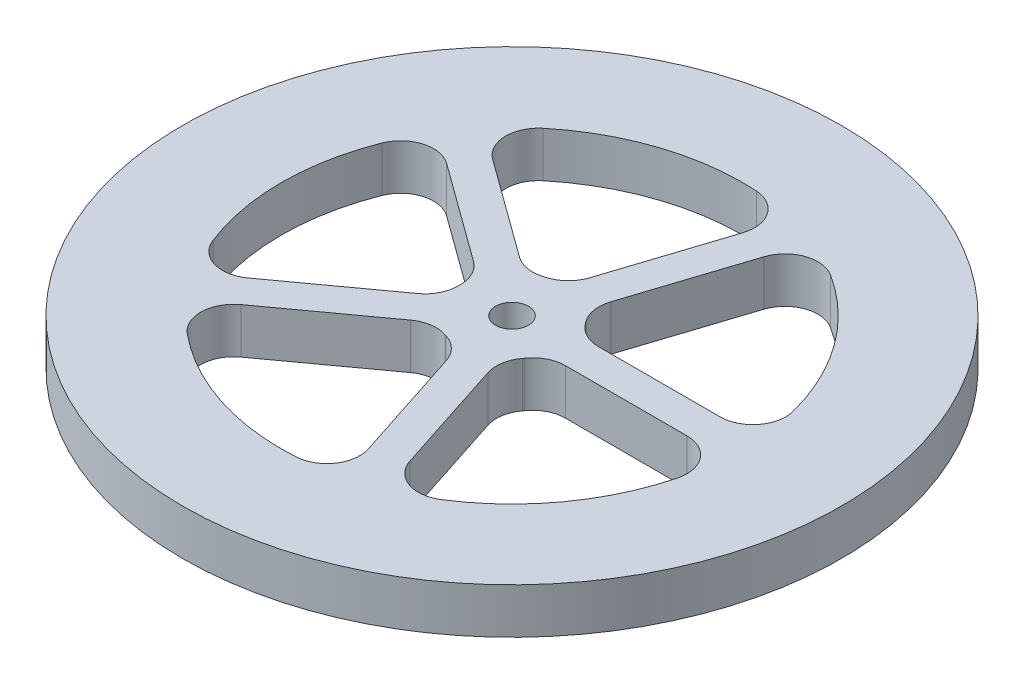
ISO-10303-21;
HEADER;
FILE_DESCRIPTION(('STEP AP214'),'2;1');
FILE_NAME('part.step','',(''),(''),'','','');
FILE_SCHEMA(('AUTOMOTIVE_DESIGN { 1 0 10303 214 1 1 1 1 }'));
ENDSEC;
DATA;
#1=APPLICATION_CONTEXT('core data for automotive mechanical design processes');
#2=APPLICATION_PROTOCOL_DEFINITION('international standard','automotive_design',2000,#1);
#3=PRODUCT_CONTEXT('',#1,'mechanical');
#4=PRODUCT('Part','Part','',(#3));
#5=PRODUCT_RELATED_PRODUCT_CATEGORY('part','',(#4));
#6=PRODUCT_DEFINITION_FORMATION('','',#4);
#7=PRODUCT_DEFINITION_CONTEXT('part definition',#1,'design');
#8=PRODUCT_DEFINITION('design','',#6,#7);
#9=PRODUCT_DEFINITION_SHAPE('','',#8);
#10=(LENGTH_UNIT() NAMED_UNIT(*) SI_UNIT(.MILLI.,.METRE.));
#11=(NAMED_UNIT(*) PLANE_ANGLE_UNIT() SI_UNIT($,.RADIAN.));
#12=(NAMED_UNIT(*) SI_UNIT($,.STERADIAN.) SOLID_ANGLE_UNIT());
#13=UNCERTAINTY_MEASURE_WITH_UNIT(LENGTH_MEASURE(1.E-05),#10,'distance_accuracy_value','');
#14=(GEOMETRIC_REPRESENTATION_CONTEXT(3) GLOBAL_UNCERTAINTY_ASSIGNED_CONTEXT((#13)) GLOBAL_UNIT_ASSIGNED_CONTEXT((#10,
#11,#12)) REPRESENTATION_CONTEXT('',''));
#15=CARTESIAN_POINT('',(0.,0.,0.));
#16=DIRECTION('',(0.,0.,1.));
#17=DIRECTION('',(1.,0.,0.));
#18=AXIS2_PLACEMENT_3D('',#15,#16,#17);
#19=CARTESIAN_POINT('',(0.,8.763,0.));
#20=DIRECTION('',(0.,1.,0.));
#21=DIRECTION('',(0.,0.,1.));
#22=AXIS2_PLACEMENT_3D('',#19,#20,#21);
#23=PLANE('',#22);
#24=CARTESIAN_POINT('',(-5.31121710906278,8.763,-15.6323725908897));
#25=DIRECTION('',(0.,1.,0.));
#26=DIRECTION('',(0.,0.,-1.));
#27=AXIS2_PLACEMENT_3D('',#24,#25,#26);
#28=CIRCLE('',#27,6.35);
#29=CARTESIAN_POINT('',(-9.0436534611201,8.763,-10.4951146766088));
#30=VERTEX_POINT('',#29);
#31=CARTESIAN_POINT('',(-3.26844129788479,8.763,-9.61992159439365));
#32=VERTEX_POINT('',#31);
#33=EDGE_CURVE('E47',#30,#32,#28,.T.);
#34=ORIENTED_EDGE('',*,*,#33,.F.);
#35=DIRECTION('',(0.809016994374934,0.,0.587785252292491));
#36=VECTOR('',#35,1.);
#37=CARTESIAN_POINT('',(-9.0436534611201,8.763,-10.4951146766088));
#38=LINE('',#37,#36);
#39=CARTESIAN_POINT('',(-27.9785533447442,8.763,-24.2521247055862));
#40=VERTEX_POINT('',#39);
#41=EDGE_CURVE('E308',#40,#30,#38,.T.);
#42=ORIENTED_EDGE('',*,*,#41,.F.);
#43=CARTESIAN_POINT('',(-24.2461169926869,8.763,-29.389382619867));
#44=DIRECTION('',(0.,1.,0.));
#45=DIRECTION('',(0.,0.,1.));
#46=AXIS2_PLACEMENT_3D('',#43,#44,#45);
#47=CIRCLE('',#46,6.35);
#48=CARTESIAN_POINT('',(-28.287136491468,8.763,-34.2876130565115));
#49=VERTEX_POINT('',#48);
#50=EDGE_CURVE('E311',#49,#40,#47,.T.);
#51=ORIENTED_EDGE('',*,*,#50,.F.);
#52=CARTESIAN_POINT('',(0.,8.763,0.));
#53=DIRECTION('',(0.,1.,0.));
#54=DIRECTION('',(0.,0.,1.));
#55=AXIS2_PLACEMENT_3D('',#52,#53,#54);
#56=CIRCLE('',#55,44.45);
#57=CARTESIAN_POINT('',(2.73102085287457,8.763,-44.3660233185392));
#58=VERTEX_POINT('',#57);
#59=EDGE_CURVE('E339',#58,#49,#56,.T.);
#60=ORIENTED_EDGE('',*,*,#59,.F.);
#61=CARTESIAN_POINT('',(2.34087501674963,8.763,-38.0280199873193));
#62=DIRECTION('',(0.,1.,0.));
#63=DIRECTION('',(0.,0.,1.));
#64=AXIS2_PLACEMENT_3D('',#61,#62,#63);
#65=CIRCLE('',#64,6.35);
#66=CARTESIAN_POINT('',(8.38008389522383,8.763,-36.0657620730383));
#67=VERTEX_POINT('',#66);
#68=EDGE_CURVE('E336',#67,#58,#65,.T.);
#69=ORIENTED_EDGE('',*,*,#68,.F.);
#70=DIRECTION('',(0.309016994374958,0.,-0.95105651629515));
#71=VECTOR('',#70,1.);
#72=CARTESIAN_POINT('',(1.14759571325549,8.763,-13.8064522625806));
#73=LINE('',#72,#71);
#74=CARTESIAN_POINT('',(1.14759571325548,8.763,-13.8064522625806));
#75=VERTEX_POINT('',#74);
#76=EDGE_CURVE('E333',#75,#67,#73,.T.);
#77=ORIENTED_EDGE('',*,*,#76,.F.);
#78=CARTESIAN_POINT('',(-4.89161316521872,8.763,-15.7687101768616));
#79=DIRECTION('',(0.,1.,0.));
#80=DIRECTION('',(0.,0.,-1.));
#81=AXIS2_PLACEMENT_3D('',#78,#79,#80);
#82=CIRCLE('',#81,6.35);
#83=CARTESIAN_POINT('',(-3.01022348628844,8.763,-9.70382164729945));
#84=VERTEX_POINT('',#83);
#85=EDGE_CURVE('E330',#84,#75,#82,.T.);
#86=ORIENTED_EDGE('',*,*,#85,.F.);
#87=DIRECTION('',(0.951056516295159,0.,-0.309016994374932));
#88=VECTOR('',#87,1.);
#89=CARTESIAN_POINT('',(-3.26844129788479,8.763,-9.61992159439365));
#90=LINE('',#89,#88);
#91=EDGE_CURVE('E328',#32,#84,#90,.T.);
#92=ORIENTED_EDGE('',*,*,#91,.F.);
#93=EDGE_LOOP('',(#34,#42,#51,#60,#69,#77,#86,#92));
#94=FACE_BOUND('',#93,.T.);
#95=CARTESIAN_POINT('',(-16.5085261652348,8.763,0.220598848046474));
#96=DIRECTION('',(0.,1.,0.));
#97=DIRECTION('',(0.,0.,-1.));
#98=AXIS2_PLACEMENT_3D('',#95,#96,#97);
#99=CIRCLE('',#98,6.35);
#100=CARTESIAN_POINT('',(-12.7760898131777,8.763,5.35785676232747));
#101=VERTEX_POINT('',#100);
#102=CARTESIAN_POINT('',(-10.1590930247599,8.763,0.135753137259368));
#103=VERTEX_POINT('',#102);
#104=EDGE_CURVE('E346',#101,#103,#99,.T.);
#105=ORIENTED_EDGE('',*,*,#104,.F.);
#106=DIRECTION('',(0.809016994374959,0.,-0.587785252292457));
#107=VECTOR('',#106,1.);
#108=CARTESIAN_POINT('',(-12.7760898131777,8.763,5.35785676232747));
#109=LINE('',#108,#107);
#110=CARTESIAN_POINT('',(-31.7109896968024,8.763,19.114866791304));
#111=VERTEX_POINT('',#110);
#112=EDGE_CURVE('E362',#111,#101,#109,.T.);
#113=ORIENTED_EDGE('',*,*,#112,.F.);
#114=CARTESIAN_POINT('',(-35.4434260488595,8.763,13.977608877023));
#115=DIRECTION('',(0.,1.,0.));
#116=DIRECTION('',(0.,0.,1.));
#117=AXIS2_PLACEMENT_3D('',#114,#115,#116);
#118=CIRCLE('',#117,6.35);
#119=CARTESIAN_POINT('',(-41.3506637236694,8.763,16.3072103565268));
#120=VERTEX_POINT('',#119);
#121=EDGE_CURVE('E400',#120,#111,#118,.T.);
#122=ORIENTED_EDGE('',*,*,#121,.F.);
#123=CARTESIAN_POINT('',(0.,8.763,0.));
#124=DIRECTION('',(0.,1.,0.));
#125=DIRECTION('',(0.,0.,1.));
#126=AXIS2_PLACEMENT_3D('',#123,#124,#125);
#127=CIRCLE('',#126,44.45);
#128=CARTESIAN_POINT('',(-41.3506637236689,8.763,-16.307210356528));
#129=VERTEX_POINT('',#128);
#130=EDGE_CURVE('E397',#129,#120,#127,.T.);
#131=ORIENTED_EDGE('',*,*,#130,.F.);
#132=CARTESIAN_POINT('',(-35.443426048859,8.763,-13.977608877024));
#133=DIRECTION('',(0.,1.,0.));
#134=DIRECTION('',(0.,0.,1.));
#135=AXIS2_PLACEMENT_3D('',#132,#133,#134);
#136=CIRCLE('',#135,6.35);
#137=CARTESIAN_POINT('',(-31.7109896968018,8.763,-19.1148667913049));
#138=VERTEX_POINT('',#137);
#139=EDGE_CURVE('E394',#138,#129,#136,.T.);
#140=ORIENTED_EDGE('',*,*,#139,.F.);
#141=DIRECTION('',(-0.809016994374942,0.,-0.58778525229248));
#142=VECTOR('',#141,1.);
#143=CARTESIAN_POINT('',(-12.7760898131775,8.763,-5.35785676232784));
#144=LINE('',#143,#142);
#145=CARTESIAN_POINT('',(-12.7760898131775,8.763,-5.35785676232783));
#146=VERTEX_POINT('',#145);
#147=EDGE_CURVE('E391',#146,#138,#144,.T.);
#148=ORIENTED_EDGE('',*,*,#147,.F.);
#149=CARTESIAN_POINT('',(-16.5085261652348,8.763,-0.220598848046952));
#150=DIRECTION('',(0.,1.,0.));
#151=DIRECTION('',(0.,0.,-1.));
#152=AXIS2_PLACEMENT_3D('',#149,#150,#151);
#153=CIRCLE('',#152,6.35);
#154=CARTESIAN_POINT('',(-10.1590930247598,8.763,-0.135753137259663));
#155=VERTEX_POINT('',#154);
#156=EDGE_CURVE('E388',#155,#146,#153,.T.);
#157=ORIENTED_EDGE('',*,*,#156,.F.);
#158=DIRECTION('',(0.,0.,-1.));
#159=VECTOR('',#158,1.);
#160=CARTESIAN_POINT('',(-10.1590930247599,8.763,0.135753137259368));
#161=LINE('',#160,#159);
#162=EDGE_CURVE('E385',#103,#155,#161,.T.);
#163=ORIENTED_EDGE('',*,*,#162,.F.);
#164=EDGE_LOOP('',(#105,#113,#122,#131,#140,#148,#157,#163));
#165=FACE_BOUND('',#164,.T.);
#166=CARTESIAN_POINT('',(-4.89161316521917,8.763,15.7687101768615));
#167=DIRECTION('',(0.,1.,0.));
#168=DIRECTION('',(0.,0.,-1.));
#169=AXIS2_PLACEMENT_3D('',#166,#167,#168);
#170=CIRCLE('',#169,6.35);
#171=CARTESIAN_POINT('',(1.14759571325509,8.763,13.8064522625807));
#172=VERTEX_POINT('',#171);
#173=CARTESIAN_POINT('',(-3.01022348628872,8.763,9.70382164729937));
#174=VERTEX_POINT('',#173);
#175=EDGE_CURVE('E407',#172,#174,#170,.T.);
#176=ORIENTED_EDGE('',*,*,#175,.F.);
#177=DIRECTION('',(-0.309016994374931,0.,-0.951056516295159));
#178=VECTOR('',#177,1.);
#179=CARTESIAN_POINT('',(1.14759571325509,8.763,13.8064522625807));
#180=LINE('',#179,#178);
#181=CARTESIAN_POINT('',(8.38008389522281,8.763,36.0657620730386));
#182=VERTEX_POINT('',#181);
#183=EDGE_CURVE('E426',#182,#172,#180,.T.);
#184=ORIENTED_EDGE('',*,*,#183,.F.);
#185=CARTESIAN_POINT('',(2.34087501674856,8.763,38.0280199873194));
#186=DIRECTION('',(0.,1.,0.));
#187=DIRECTION('',(0.,0.,1.));
#188=AXIS2_PLACEMENT_3D('',#185,#186,#187);
#189=CIRCLE('',#188,6.35);
#190=CARTESIAN_POINT('',(2.73102085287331,8.763,44.3660233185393));
#191=VERTEX_POINT('',#190);
#192=EDGE_CURVE('E464',#191,#182,#189,.T.);
#193=ORIENTED_EDGE('',*,*,#192,.F.);
#194=CARTESIAN_POINT('',(0.,8.763,0.));
#195=DIRECTION('',(0.,1.,0.));
#196=DIRECTION('',(0.,0.,1.));
#197=AXIS2_PLACEMENT_3D('',#194,#195,#196);
#198=CIRCLE('',#197,44.45);
#199=CARTESIAN_POINT('',(-28.287136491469,8.763,34.2876130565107));
#200=VERTEX_POINT('',#199);
#201=EDGE_CURVE('E461',#200,#191,#198,.T.);
#202=ORIENTED_EDGE('',*,*,#201,.F.);
#203=CARTESIAN_POINT('',(-24.2461169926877,8.763,29.3893826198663));
#204=DIRECTION('',(0.,1.,0.));
#205=DIRECTION('',(0.,0.,1.));
#206=AXIS2_PLACEMENT_3D('',#203,#204,#205);
#207=CIRCLE('',#206,6.35);
#208=CARTESIAN_POINT('',(-27.9785533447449,8.763,24.2521247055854));
#209=VERTEX_POINT('',#208);
#210=EDGE_CURVE('E458',#209,#200,#207,.T.);
#211=ORIENTED_EDGE('',*,*,#210,.F.);
#212=DIRECTION('',(-0.809016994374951,0.,0.587785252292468));
#213=VECTOR('',#212,1.);
#214=CARTESIAN_POINT('',(-9.0436534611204,8.763,10.4951146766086));
#215=LINE('',#214,#213);
#216=CARTESIAN_POINT('',(-9.0436534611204,8.763,10.4951146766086));
#217=VERTEX_POINT('',#216);
#218=EDGE_CURVE('E455',#217,#209,#215,.T.);
#219=ORIENTED_EDGE('',*,*,#218,.F.);
#220=CARTESIAN_POINT('',(-5.31121710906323,8.763,15.6323725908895));
#221=DIRECTION('',(0.,1.,0.));
#222=DIRECTION('',(0.,0.,-1.));
#223=AXIS2_PLACEMENT_3D('',#220,#221,#222);
#224=CIRCLE('',#223,6.35);
#225=CARTESIAN_POINT('',(-3.26844129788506,8.763,9.61992159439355));
#226=VERTEX_POINT('',#225);
#227=EDGE_CURVE('E452',#226,#217,#224,.T.);
#228=ORIENTED_EDGE('',*,*,#227,.F.);
#229=DIRECTION('',(-0.95105651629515,0.,-0.309016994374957));
#230=VECTOR('',#229,1.);
#231=CARTESIAN_POINT('',(-3.01022348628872,8.763,9.70382164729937));
#232=LINE('',#231,#230);
#233=EDGE_CURVE('E449',#174,#226,#232,.T.);
#234=ORIENTED_EDGE('',*,*,#233,.F.);
#235=EDGE_LOOP('',(#176,#184,#193,#202,#211,#219,#228,#234));
#236=FACE_BOUND('',#235,.T.);
#237=CARTESIAN_POINT('',(13.4853429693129,8.763,9.5250000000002));
#238=DIRECTION('',(0.,1.,0.));
#239=DIRECTION('',(0.,0.,-1.));
#240=AXIS2_PLACEMENT_3D('',#237,#238,#239);
#241=CIRCLE('',#240,6.35);
#242=CARTESIAN_POINT('',(13.485342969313,8.763,3.1750000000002));
#243=VERTEX_POINT('',#242);
#244=CARTESIAN_POINT('',(8.29867259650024,8.763,5.86153846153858));
#245=VERTEX_POINT('',#244);
#246=EDGE_CURVE('E471',#243,#245,#241,.T.);
#247=ORIENTED_EDGE('',*,*,#246,.F.);
#248=DIRECTION('',(-1.,0.,0.));
#249=VECTOR('',#248,1.);
#250=CARTESIAN_POINT('',(13.485342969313,8.763,3.1750000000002));
#251=LINE('',#250,#249);
#252=CARTESIAN_POINT('',(36.8901663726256,8.763,3.17500000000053));
#253=VERTEX_POINT('',#252);
#254=EDGE_CURVE('E490',#253,#243,#251,.T.);
#255=ORIENTED_EDGE('',*,*,#254,.F.);
#256=CARTESIAN_POINT('',(36.8901663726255,8.763,9.52500000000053));
#257=DIRECTION('',(0.,1.,0.));
#258=DIRECTION('',(0.,0.,1.));
#259=AXIS2_PLACEMENT_3D('',#256,#257,#258);
#260=CIRCLE('',#259,6.35);
#261=CARTESIAN_POINT('',(43.0385274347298,8.763,11.1125000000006));
#262=VERTEX_POINT('',#261);
#263=EDGE_CURVE('E528',#262,#253,#260,.T.);
#264=ORIENTED_EDGE('',*,*,#263,.F.);
#265=CARTESIAN_POINT('',(0.,8.763,0.));
#266=DIRECTION('',(0.,1.,0.));
#267=DIRECTION('',(0.,0.,1.));
#268=AXIS2_PLACEMENT_3D('',#265,#266,#267);
#269=CIRCLE('',#268,44.45);
#270=CARTESIAN_POINT('',(23.8682519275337,8.763,37.4981206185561));
#271=VERTEX_POINT('',#270);
#272=EDGE_CURVE('E525',#271,#262,#269,.T.);
#273=ORIENTED_EDGE('',*,*,#272,.F.);
#274=CARTESIAN_POINT('',(20.4585016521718,8.763,32.1412462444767));
#275=DIRECTION('',(0.,1.,0.));
#276=DIRECTION('',(0.,0.,1.));
#277=AXIS2_PLACEMENT_3D('',#274,#275,#276);
#278=CIRCLE('',#277,6.35);
#279=CARTESIAN_POINT('',(14.4192927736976,8.763,34.1035041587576));
#280=VERTEX_POINT('',#279);
#281=EDGE_CURVE('E522',#280,#271,#278,.T.);
#282=ORIENTED_EDGE('',*,*,#281,.F.);
#283=DIRECTION('',(0.309016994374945,0.,0.951056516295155));
#284=VECTOR('',#283,1.);
#285=CARTESIAN_POINT('',(7.18680459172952,8.763,11.8441943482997));
#286=LINE('',#285,#284);
#287=CARTESIAN_POINT('',(7.18680459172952,8.763,11.8441943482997));
#288=VERTEX_POINT('',#287);
#289=EDGE_CURVE('E519',#288,#280,#286,.T.);
#290=ORIENTED_EDGE('',*,*,#289,.F.);
#291=CARTESIAN_POINT('',(13.2260134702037,8.763,9.88193643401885));
#292=DIRECTION('',(0.,1.,0.));
#293=DIRECTION('',(0.,0.,-1.));
#294=AXIS2_PLACEMENT_3D('',#291,#292,#293);
#295=CIRCLE('',#294,6.35);
#296=CARTESIAN_POINT('',(8.13908521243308,8.763,6.08119165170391));
#297=VERTEX_POINT('',#296);
#298=EDGE_CURVE('E516',#297,#288,#295,.T.);
#299=ORIENTED_EDGE('',*,*,#298,.F.);
#300=DIRECTION('',(-0.587785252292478,0.,0.809016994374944));
#301=VECTOR('',#300,1.);
#302=CARTESIAN_POINT('',(8.29867259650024,8.763,5.86153846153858));
#303=LINE('',#302,#301);
#304=EDGE_CURVE('E513',#245,#297,#303,.T.);
#305=ORIENTED_EDGE('',*,*,#304,.F.);
#306=EDGE_LOOP('',(#247,#255,#264,#273,#282,#290,#299,#305));
#307=FACE_BOUND('',#306,.T.);
#308=CARTESIAN_POINT('',(13.2260134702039,8.763,-9.88193643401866));
#309=DIRECTION('',(0.,1.,0.));
#310=DIRECTION('',(0.,0.,-1.));
#311=AXIS2_PLACEMENT_3D('',#308,#309,#310);
#312=CIRCLE('',#311,6.35);
#313=CARTESIAN_POINT('',(7.18680459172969,8.763,-11.8441943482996));
#314=VERTEX_POINT('',#313);
#315=CARTESIAN_POINT('',(8.13908521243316,8.763,-6.08119165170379));
#316=VERTEX_POINT('',#315);
#317=EDGE_CURVE('E535',#314,#316,#312,.T.);
#318=ORIENTED_EDGE('',*,*,#317,.F.);
#319=DIRECTION('',(-0.309016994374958,0.,0.95105651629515));
#320=VECTOR('',#319,1.);
#321=CARTESIAN_POINT('',(7.18680459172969,8.763,-11.8441943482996));
#322=LINE('',#321,#320);
#323=CARTESIAN_POINT('',(14.419292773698,8.763,-34.1035041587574));
#324=VERTEX_POINT('',#323);
#325=EDGE_CURVE('E554',#324,#314,#322,.T.);
#326=ORIENTED_EDGE('',*,*,#325,.F.);
#327=CARTESIAN_POINT('',(20.4585016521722,8.763,-32.1412462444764));
#328=DIRECTION('',(0.,1.,0.));
#329=DIRECTION('',(0.,0.,1.));
#330=AXIS2_PLACEMENT_3D('',#327,#328,#329);
#331=CIRCLE('',#330,6.35);
#332=CARTESIAN_POINT('',(23.8682519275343,8.763,-37.4981206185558));
#333=VERTEX_POINT('',#332);
#334=EDGE_CURVE('E592',#333,#324,#331,.T.);
#335=ORIENTED_EDGE('',*,*,#334,.F.);
#336=CARTESIAN_POINT('',(0.,8.763,0.));
#337=DIRECTION('',(0.,1.,0.));
#338=DIRECTION('',(0.,0.,1.));
#339=AXIS2_PLACEMENT_3D('',#336,#337,#338);
#340=CIRCLE('',#339,44.45);
#341=CARTESIAN_POINT('',(43.0385274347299,8.763,-11.1125));
#342=VERTEX_POINT('',#341);
#343=EDGE_CURVE('E589',#342,#333,#340,.T.);
#344=ORIENTED_EDGE('',*,*,#343,.F.);
#345=CARTESIAN_POINT('',(36.8901663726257,8.763,-9.525));
#346=DIRECTION('',(0.,1.,0.));
#347=DIRECTION('',(0.,0.,1.));
#348=AXIS2_PLACEMENT_3D('',#345,#346,#347);
#349=CIRCLE('',#348,6.35);
#350=CARTESIAN_POINT('',(36.8901663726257,8.763,-3.175));
#351=VERTEX_POINT('',#350);
#352=EDGE_CURVE('E586',#351,#342,#349,.T.);
#353=ORIENTED_EDGE('',*,*,#352,.F.);
#354=DIRECTION('',(1.,0.,0.));
#355=VECTOR('',#354,1.);
#356=CARTESIAN_POINT('',(13.485342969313,8.763,-3.175));
#357=LINE('',#356,#355);
#358=CARTESIAN_POINT('',(13.485342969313,8.763,-3.175));
#359=VERTEX_POINT('',#358);
#360=EDGE_CURVE('E583',#359,#351,#357,.T.);
#361=ORIENTED_EDGE('',*,*,#360,.F.);
#362=CARTESIAN_POINT('',(13.485342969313,8.763,-9.525));
#363=DIRECTION('',(0.,1.,0.));
#364=DIRECTION('',(0.,0.,-1.));
#365=AXIS2_PLACEMENT_3D('',#362,#363,#364);
#366=CIRCLE('',#365,6.35);
#367=CARTESIAN_POINT('',(8.29867259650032,8.763,-5.86153846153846));
#368=VERTEX_POINT('',#367);
#369=EDGE_CURVE('E580',#368,#359,#366,.T.);
#370=ORIENTED_EDGE('',*,*,#369,.F.);
#371=DIRECTION('',(0.587785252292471,0.,0.809016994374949));
#372=VECTOR('',#371,1.);
#373=CARTESIAN_POINT('',(8.13908521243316,8.763,-6.08119165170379));
#374=LINE('',#373,#372);
#375=EDGE_CURVE('E577',#316,#368,#374,.T.);
#376=ORIENTED_EDGE('',*,*,#375,.F.);
#377=EDGE_LOOP('',(#318,#326,#335,#344,#353,#361,#370,#376));
#378=FACE_BOUND('',#377,.T.);
#379=CARTESIAN_POINT('',(0.,8.763,0.));
#380=DIRECTION('',(0.,1.,0.));
#381=DIRECTION('',(0.,0.,1.));
#382=AXIS2_PLACEMENT_3D('',#379,#380,#381);
#383=CIRCLE('',#382,63.5);
#384=CARTESIAN_POINT('',(0.,8.763,63.5));
#385=VERTEX_POINT('',#384);
#386=EDGE_CURVE('E11',#385,#385,#383,.T.);
#387=ORIENTED_EDGE('',*,*,#386,.T.);
#388=EDGE_LOOP('',(#387));
#389=FACE_BOUND('',#388,.T.);
#390=CARTESIAN_POINT('',(0.,8.763,0.));
#391=DIRECTION('',(0.,1.,0.));
#392=DIRECTION('',(0.,0.,1.));
#393=AXIS2_PLACEMENT_3D('',#390,#391,#392);
#394=CIRCLE('',#393,3.175);
#395=CARTESIAN_POINT('',(0.,8.763,3.175));
#396=VERTEX_POINT('',#395);
#397=EDGE_CURVE('E614',#396,#396,#394,.T.);
#398=ORIENTED_EDGE('',*,*,#397,.F.);
#399=EDGE_LOOP('',(#398));
#400=FACE_BOUND('',#399,.T.);
#401=ADVANCED_FACE('F32',(#94,#165,#236,#307,#378,#389,#400),#23,.T.);
#402=CARTESIAN_POINT('',(0.,0.,0.));
#403=DIRECTION('',(0.,1.,0.));
#404=DIRECTION('',(0.,0.,1.));
#405=AXIS2_PLACEMENT_3D('',#402,#403,#404);
#406=PLANE('',#405);
#407=DIRECTION('',(0.809016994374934,0.,0.587785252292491));
#408=VECTOR('',#407,1.);
#409=CARTESIAN_POINT('',(-9.0436534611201,0.,-10.4951146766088));
#410=LINE('',#409,#408);
#411=CARTESIAN_POINT('',(-27.9785533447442,0.,-24.2521247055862));
#412=VERTEX_POINT('',#411);
#413=CARTESIAN_POINT('',(-9.0436534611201,0.,-10.4951146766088));
#414=VERTEX_POINT('',#413);
#415=EDGE_CURVE('E297',#412,#414,#410,.T.);
#416=ORIENTED_EDGE('',*,*,#415,.T.);
#417=CARTESIAN_POINT('',(-5.31121710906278,0.,-15.6323725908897));
#418=DIRECTION('',(0.,1.,0.));
#419=DIRECTION('',(0.,0.,-1.));
#420=AXIS2_PLACEMENT_3D('',#417,#418,#419);
#421=CIRCLE('',#420,6.35);
#422=CARTESIAN_POINT('',(-3.26844129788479,0.,-9.61992159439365));
#423=VERTEX_POINT('',#422);
#424=EDGE_CURVE('E291',#414,#423,#421,.T.);
#425=ORIENTED_EDGE('',*,*,#424,.T.);
#426=DIRECTION('',(0.951056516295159,0.,-0.309016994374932));
#427=VECTOR('',#426,1.);
#428=CARTESIAN_POINT('',(-3.26844129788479,0.,-9.61992159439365));
#429=LINE('',#428,#427);
#430=CARTESIAN_POINT('',(-3.01022348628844,0.,-9.70382164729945));
#431=VERTEX_POINT('',#430);
#432=EDGE_CURVE('E300',#423,#431,#429,.T.);
#433=ORIENTED_EDGE('',*,*,#432,.T.);
#434=CARTESIAN_POINT('',(-4.89161316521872,0.,-15.7687101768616));
#435=DIRECTION('',(0.,1.,0.));
#436=DIRECTION('',(0.,0.,-1.));
#437=AXIS2_PLACEMENT_3D('',#434,#435,#436);
#438=CIRCLE('',#437,6.35);
#439=CARTESIAN_POINT('',(1.14759571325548,0.,-13.8064522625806));
#440=VERTEX_POINT('',#439);
#441=EDGE_CURVE('E55',#431,#440,#438,.T.);
#442=ORIENTED_EDGE('',*,*,#441,.T.);
#443=DIRECTION('',(0.309016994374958,0.,-0.95105651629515));
#444=VECTOR('',#443,1.);
#445=CARTESIAN_POINT('',(1.14759571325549,0.,-13.8064522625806));
#446=LINE('',#445,#444);
#447=CARTESIAN_POINT('',(8.38008389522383,0.,-36.0657620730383));
#448=VERTEX_POINT('',#447);
#449=EDGE_CURVE('E315',#440,#448,#446,.T.);
#450=ORIENTED_EDGE('',*,*,#449,.T.);
#451=CARTESIAN_POINT('',(2.34087501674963,0.,-38.0280199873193));
#452=DIRECTION('',(0.,1.,0.));
#453=DIRECTION('',(0.,0.,1.));
#454=AXIS2_PLACEMENT_3D('',#451,#452,#453);
#455=CIRCLE('',#454,6.35);
#456=CARTESIAN_POINT('',(2.73102085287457,0.,-44.3660233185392));
#457=VERTEX_POINT('',#456);
#458=EDGE_CURVE('E318',#448,#457,#455,.T.);
#459=ORIENTED_EDGE('',*,*,#458,.T.);
#460=CARTESIAN_POINT('',(0.,0.,0.));
#461=DIRECTION('',(0.,1.,0.));
#462=DIRECTION('',(0.,0.,1.));
#463=AXIS2_PLACEMENT_3D('',#460,#461,#462);
#464=CIRCLE('',#463,44.45);
#465=CARTESIAN_POINT('',(-28.287136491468,0.,-34.2876130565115));
#466=VERTEX_POINT('',#465);
#467=EDGE_CURVE('E321',#457,#466,#464,.T.);
#468=ORIENTED_EDGE('',*,*,#467,.T.);
#469=CARTESIAN_POINT('',(-24.2461169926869,0.,-29.389382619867));
#470=DIRECTION('',(0.,1.,0.));
#471=DIRECTION('',(0.,0.,1.));
#472=AXIS2_PLACEMENT_3D('',#469,#470,#471);
#473=CIRCLE('',#472,6.35);
#474=EDGE_CURVE('E324',#466,#412,#473,.T.);
#475=ORIENTED_EDGE('',*,*,#474,.T.);
#476=EDGE_LOOP('',(#416,#425,#433,#442,#450,#459,#468,#475));
#477=FACE_BOUND('',#476,.T.);
#478=DIRECTION('',(0.809016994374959,0.,-0.587785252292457));
#479=VECTOR('',#478,1.);
#480=CARTESIAN_POINT('',(-12.7760898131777,0.,5.35785676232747));
#481=LINE('',#480,#479);
#482=CARTESIAN_POINT('',(-31.7109896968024,0.,19.114866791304));
#483=VERTEX_POINT('',#482);
#484=CARTESIAN_POINT('',(-12.7760898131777,0.,5.35785676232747));
#485=VERTEX_POINT('',#484);
#486=EDGE_CURVE('E380',#483,#485,#481,.T.);
#487=ORIENTED_EDGE('',*,*,#486,.T.);
#488=CARTESIAN_POINT('',(-16.5085261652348,0.,0.220598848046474));
#489=DIRECTION('',(0.,1.,0.));
#490=DIRECTION('',(0.,0.,-1.));
#491=AXIS2_PLACEMENT_3D('',#488,#489,#490);
#492=CIRCLE('',#491,6.35);
#493=CARTESIAN_POINT('',(-10.1590930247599,0.,0.135753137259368));
#494=VERTEX_POINT('',#493);
#495=EDGE_CURVE('E358',#485,#494,#492,.T.);
#496=ORIENTED_EDGE('',*,*,#495,.T.);
#497=DIRECTION('',(0.,0.,-1.));
#498=VECTOR('',#497,1.);
#499=CARTESIAN_POINT('',(-10.1590930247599,0.,0.135753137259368));
#500=LINE('',#499,#498);
#501=CARTESIAN_POINT('',(-10.1590930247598,0.,-0.135753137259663));
#502=VERTEX_POINT('',#501);
#503=EDGE_CURVE('E361',#494,#502,#500,.T.);
#504=ORIENTED_EDGE('',*,*,#503,.T.);
#505=CARTESIAN_POINT('',(-16.5085261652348,0.,-0.220598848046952));
#506=DIRECTION('',(0.,1.,0.));
#507=DIRECTION('',(0.,0.,-1.));
#508=AXIS2_PLACEMENT_3D('',#505,#506,#507);
#509=CIRCLE('',#508,6.35);
#510=CARTESIAN_POINT('',(-12.7760898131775,0.,-5.35785676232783));
#511=VERTEX_POINT('',#510);
#512=EDGE_CURVE('E365',#502,#511,#509,.T.);
#513=ORIENTED_EDGE('',*,*,#512,.T.);
#514=DIRECTION('',(-0.809016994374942,0.,-0.58778525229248));
#515=VECTOR('',#514,1.);
#516=CARTESIAN_POINT('',(-12.7760898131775,0.,-5.35785676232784));
#517=LINE('',#516,#515);
#518=CARTESIAN_POINT('',(-31.7109896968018,0.,-19.1148667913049));
#519=VERTEX_POINT('',#518);
#520=EDGE_CURVE('E368',#511,#519,#517,.T.);
#521=ORIENTED_EDGE('',*,*,#520,.T.);
#522=CARTESIAN_POINT('',(-35.443426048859,0.,-13.977608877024));
#523=DIRECTION('',(0.,1.,0.));
#524=DIRECTION('',(0.,0.,1.));
#525=AXIS2_PLACEMENT_3D('',#522,#523,#524);
#526=CIRCLE('',#525,6.35);
#527=CARTESIAN_POINT('',(-41.3506637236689,0.,-16.307210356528));
#528=VERTEX_POINT('',#527);
#529=EDGE_CURVE('E371',#519,#528,#526,.T.);
#530=ORIENTED_EDGE('',*,*,#529,.T.);
#531=CARTESIAN_POINT('',(0.,0.,0.));
#532=DIRECTION('',(0.,1.,0.));
#533=DIRECTION('',(0.,0.,1.));
#534=AXIS2_PLACEMENT_3D('',#531,#532,#533);
#535=CIRCLE('',#534,44.45);
#536=CARTESIAN_POINT('',(-41.3506637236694,0.,16.3072103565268));
#537=VERTEX_POINT('',#536);
#538=EDGE_CURVE('E374',#528,#537,#535,.T.);
#539=ORIENTED_EDGE('',*,*,#538,.T.);
#540=CARTESIAN_POINT('',(-35.4434260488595,0.,13.977608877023));
#541=DIRECTION('',(0.,1.,0.));
#542=DIRECTION('',(0.,0.,1.));
#543=AXIS2_PLACEMENT_3D('',#540,#541,#542);
#544=CIRCLE('',#543,6.35);
#545=EDGE_CURVE('E377',#537,#483,#544,.T.);
#546=ORIENTED_EDGE('',*,*,#545,.T.);
#547=EDGE_LOOP('',(#487,#496,#504,#513,#521,#530,#539,#546));
#548=FACE_BOUND('',#547,.T.);
#549=DIRECTION('',(-0.309016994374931,0.,-0.951056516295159));
#550=VECTOR('',#549,1.);
#551=CARTESIAN_POINT('',(1.14759571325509,0.,13.8064522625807));
#552=LINE('',#551,#550);
#553=CARTESIAN_POINT('',(8.38008389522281,0.,36.0657620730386));
#554=VERTEX_POINT('',#553);
#555=CARTESIAN_POINT('',(1.14759571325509,0.,13.8064522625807));
#556=VERTEX_POINT('',#555);
#557=EDGE_CURVE('E444',#554,#556,#552,.T.);
#558=ORIENTED_EDGE('',*,*,#557,.T.);
#559=CARTESIAN_POINT('',(-4.89161316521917,0.,15.7687101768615));
#560=DIRECTION('',(0.,1.,0.));
#561=DIRECTION('',(0.,0.,-1.));
#562=AXIS2_PLACEMENT_3D('',#559,#560,#561);
#563=CIRCLE('',#562,6.35);
#564=CARTESIAN_POINT('',(-3.01022348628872,0.,9.70382164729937));
#565=VERTEX_POINT('',#564);
#566=EDGE_CURVE('E422',#556,#565,#563,.T.);
#567=ORIENTED_EDGE('',*,*,#566,.T.);
#568=DIRECTION('',(-0.95105651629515,0.,-0.309016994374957));
#569=VECTOR('',#568,1.);
#570=CARTESIAN_POINT('',(-3.01022348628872,0.,9.70382164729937));
#571=LINE('',#570,#569);
#572=CARTESIAN_POINT('',(-3.26844129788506,0.,9.61992159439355));
#573=VERTEX_POINT('',#572);
#574=EDGE_CURVE('E425',#565,#573,#571,.T.);
#575=ORIENTED_EDGE('',*,*,#574,.T.);
#576=CARTESIAN_POINT('',(-5.31121710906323,0.,15.6323725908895));
#577=DIRECTION('',(0.,1.,0.));
#578=DIRECTION('',(0.,0.,-1.));
#579=AXIS2_PLACEMENT_3D('',#576,#577,#578);
#580=CIRCLE('',#579,6.35);
#581=CARTESIAN_POINT('',(-9.0436534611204,0.,10.4951146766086));
#582=VERTEX_POINT('',#581);
#583=EDGE_CURVE('E429',#573,#582,#580,.T.);
#584=ORIENTED_EDGE('',*,*,#583,.T.);
#585=DIRECTION('',(-0.809016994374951,0.,0.587785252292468));
#586=VECTOR('',#585,1.);
#587=CARTESIAN_POINT('',(-9.0436534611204,0.,10.4951146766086));
#588=LINE('',#587,#586);
#589=CARTESIAN_POINT('',(-27.9785533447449,0.,24.2521247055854));
#590=VERTEX_POINT('',#589);
#591=EDGE_CURVE('E432',#582,#590,#588,.T.);
#592=ORIENTED_EDGE('',*,*,#591,.T.);
#593=CARTESIAN_POINT('',(-24.2461169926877,0.,29.3893826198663));
#594=DIRECTION('',(0.,1.,0.));
#595=DIRECTION('',(0.,0.,1.));
#596=AXIS2_PLACEMENT_3D('',#593,#594,#595);
#597=CIRCLE('',#596,6.35);
#598=CARTESIAN_POINT('',(-28.287136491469,0.,34.2876130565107));
#599=VERTEX_POINT('',#598);
#600=EDGE_CURVE('E435',#590,#599,#597,.T.);
#601=ORIENTED_EDGE('',*,*,#600,.T.);
#602=CARTESIAN_POINT('',(0.,0.,0.));
#603=DIRECTION('',(0.,1.,0.));
#604=DIRECTION('',(0.,0.,1.));
#605=AXIS2_PLACEMENT_3D('',#602,#603,#604);
#606=CIRCLE('',#605,44.45);
#607=CARTESIAN_POINT('',(2.73102085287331,0.,44.3660233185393));
#608=VERTEX_POINT('',#607);
#609=EDGE_CURVE('E438',#599,#608,#606,.T.);
#610=ORIENTED_EDGE('',*,*,#609,.T.);
#611=CARTESIAN_POINT('',(2.34087501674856,0.,38.0280199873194));
#612=DIRECTION('',(0.,1.,0.));
#613=DIRECTION('',(0.,0.,1.));
#614=AXIS2_PLACEMENT_3D('',#611,#612,#613);
#615=CIRCLE('',#614,6.35);
#616=EDGE_CURVE('E441',#608,#554,#615,.T.);
#617=ORIENTED_EDGE('',*,*,#616,.T.);
#618=EDGE_LOOP('',(#558,#567,#575,#584,#592,#601,#610,#617));
#619=FACE_BOUND('',#618,.T.);
#620=DIRECTION('',(-1.,0.,0.));
#621=VECTOR('',#620,1.);
#622=CARTESIAN_POINT('',(13.485342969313,0.,3.1750000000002));
#623=LINE('',#622,#621);
#624=CARTESIAN_POINT('',(36.8901663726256,0.,3.17500000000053));
#625=VERTEX_POINT('',#624);
#626=CARTESIAN_POINT('',(13.485342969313,0.,3.1750000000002));
#627=VERTEX_POINT('',#626);
#628=EDGE_CURVE('E508',#625,#627,#623,.T.);
#629=ORIENTED_EDGE('',*,*,#628,.T.);
#630=CARTESIAN_POINT('',(13.4853429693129,0.,9.5250000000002));
#631=DIRECTION('',(0.,1.,0.));
#632=DIRECTION('',(0.,0.,-1.));
#633=AXIS2_PLACEMENT_3D('',#630,#631,#632);
#634=CIRCLE('',#633,6.35);
#635=CARTESIAN_POINT('',(8.29867259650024,0.,5.86153846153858));
#636=VERTEX_POINT('',#635);
#637=EDGE_CURVE('E486',#627,#636,#634,.T.);
#638=ORIENTED_EDGE('',*,*,#637,.T.);
#639=DIRECTION('',(-0.587785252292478,0.,0.809016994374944));
#640=VECTOR('',#639,1.);
#641=CARTESIAN_POINT('',(8.29867259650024,0.,5.86153846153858));
#642=LINE('',#641,#640);
#643=CARTESIAN_POINT('',(8.13908521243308,0.,6.08119165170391));
#644=VERTEX_POINT('',#643);
#645=EDGE_CURVE('E489',#636,#644,#642,.T.);
#646=ORIENTED_EDGE('',*,*,#645,.T.);
#647=CARTESIAN_POINT('',(13.2260134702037,0.,9.88193643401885));
#648=DIRECTION('',(0.,1.,0.));
#649=DIRECTION('',(0.,0.,-1.));
#650=AXIS2_PLACEMENT_3D('',#647,#648,#649);
#651=CIRCLE('',#650,6.35);
#652=CARTESIAN_POINT('',(7.18680459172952,0.,11.8441943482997));
#653=VERTEX_POINT('',#652);
#654=EDGE_CURVE('E493',#644,#653,#651,.T.);
#655=ORIENTED_EDGE('',*,*,#654,.T.);
#656=DIRECTION('',(0.309016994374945,0.,0.951056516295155));
#657=VECTOR('',#656,1.);
#658=CARTESIAN_POINT('',(7.18680459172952,0.,11.8441943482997));
#659=LINE('',#658,#657);
#660=CARTESIAN_POINT('',(14.4192927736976,0.,34.1035041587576));
#661=VERTEX_POINT('',#660);
#662=EDGE_CURVE('E496',#653,#661,#659,.T.);
#663=ORIENTED_EDGE('',*,*,#662,.T.);
#664=CARTESIAN_POINT('',(20.4585016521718,0.,32.1412462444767));
#665=DIRECTION('',(0.,1.,0.));
#666=DIRECTION('',(0.,0.,1.));
#667=AXIS2_PLACEMENT_3D('',#664,#665,#666);
#668=CIRCLE('',#667,6.35);
#669=CARTESIAN_POINT('',(23.8682519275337,0.,37.4981206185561));
#670=VERTEX_POINT('',#669);
#671=EDGE_CURVE('E499',#661,#670,#668,.T.);
#672=ORIENTED_EDGE('',*,*,#671,.T.);
#673=CARTESIAN_POINT('',(0.,0.,0.));
#674=DIRECTION('',(0.,1.,0.));
#675=DIRECTION('',(0.,0.,1.));
#676=AXIS2_PLACEMENT_3D('',#673,#674,#675);
#677=CIRCLE('',#676,44.45);
#678=CARTESIAN_POINT('',(43.0385274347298,0.,11.1125000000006));
#679=VERTEX_POINT('',#678);
#680=EDGE_CURVE('E502',#670,#679,#677,.T.);
#681=ORIENTED_EDGE('',*,*,#680,.T.);
#682=CARTESIAN_POINT('',(36.8901663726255,0.,9.52500000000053));
#683=DIRECTION('',(0.,1.,0.));
#684=DIRECTION('',(0.,0.,1.));
#685=AXIS2_PLACEMENT_3D('',#682,#683,#684);
#686=CIRCLE('',#685,6.35);
#687=EDGE_CURVE('E505',#679,#625,#686,.T.);
#688=ORIENTED_EDGE('',*,*,#687,.T.);
#689=EDGE_LOOP('',(#629,#638,#646,#655,#663,#672,#681,#688));
#690=FACE_BOUND('',#689,.T.);
#691=DIRECTION('',(-0.309016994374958,0.,0.95105651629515));
#692=VECTOR('',#691,1.);
#693=CARTESIAN_POINT('',(7.18680459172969,0.,-11.8441943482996));
#694=LINE('',#693,#692);
#695=CARTESIAN_POINT('',(14.419292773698,0.,-34.1035041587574));
#696=VERTEX_POINT('',#695);
#697=CARTESIAN_POINT('',(7.18680459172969,0.,-11.8441943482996));
#698=VERTEX_POINT('',#697);
#699=EDGE_CURVE('E572',#696,#698,#694,.T.);
#700=ORIENTED_EDGE('',*,*,#699,.T.);
#701=CARTESIAN_POINT('',(13.2260134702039,0.,-9.88193643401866));
#702=DIRECTION('',(0.,1.,0.));
#703=DIRECTION('',(0.,0.,-1.));
#704=AXIS2_PLACEMENT_3D('',#701,#702,#703);
#705=CIRCLE('',#704,6.35);
#706=CARTESIAN_POINT('',(8.13908521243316,0.,-6.08119165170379));
#707=VERTEX_POINT('',#706);
#708=EDGE_CURVE('E550',#698,#707,#705,.T.);
#709=ORIENTED_EDGE('',*,*,#708,.T.);
#710=DIRECTION('',(0.587785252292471,0.,0.809016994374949));
#711=VECTOR('',#710,1.);
#712=CARTESIAN_POINT('',(8.13908521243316,0.,-6.08119165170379));
#713=LINE('',#712,#711);
#714=CARTESIAN_POINT('',(8.29867259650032,0.,-5.86153846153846));
#715=VERTEX_POINT('',#714);
#716=EDGE_CURVE('E553',#707,#715,#713,.T.);
#717=ORIENTED_EDGE('',*,*,#716,.T.);
#718=CARTESIAN_POINT('',(13.485342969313,0.,-9.525));
#719=DIRECTION('',(0.,1.,0.));
#720=DIRECTION('',(0.,0.,-1.));
#721=AXIS2_PLACEMENT_3D('',#718,#719,#720);
#722=CIRCLE('',#721,6.35);
#723=CARTESIAN_POINT('',(13.485342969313,0.,-3.175));
#724=VERTEX_POINT('',#723);
#725=EDGE_CURVE('E557',#715,#724,#722,.T.);
#726=ORIENTED_EDGE('',*,*,#725,.T.);
#727=DIRECTION('',(1.,0.,0.));
#728=VECTOR('',#727,1.);
#729=CARTESIAN_POINT('',(13.485342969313,0.,-3.175));
#730=LINE('',#729,#728);
#731=CARTESIAN_POINT('',(36.8901663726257,0.,-3.175));
#732=VERTEX_POINT('',#731);
#733=EDGE_CURVE('E560',#724,#732,#730,.T.);
#734=ORIENTED_EDGE('',*,*,#733,.T.);
#735=CARTESIAN_POINT('',(36.8901663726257,0.,-9.525));
#736=DIRECTION('',(0.,1.,0.));
#737=DIRECTION('',(0.,0.,1.));
#738=AXIS2_PLACEMENT_3D('',#735,#736,#737);
#739=CIRCLE('',#738,6.35);
#740=CARTESIAN_POINT('',(43.0385274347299,0.,-11.1125));
#741=VERTEX_POINT('',#740);
#742=EDGE_CURVE('E563',#732,#741,#739,.T.);
#743=ORIENTED_EDGE('',*,*,#742,.T.);
#744=CARTESIAN_POINT('',(0.,0.,0.));
#745=DIRECTION('',(0.,1.,0.));
#746=DIRECTION('',(0.,0.,1.));
#747=AXIS2_PLACEMENT_3D('',#744,#745,#746);
#748=CIRCLE('',#747,44.45);
#749=CARTESIAN_POINT('',(23.8682519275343,0.,-37.4981206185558));
#750=VERTEX_POINT('',#749);
#751=EDGE_CURVE('E566',#741,#750,#748,.T.);
#752=ORIENTED_EDGE('',*,*,#751,.T.);
#753=CARTESIAN_POINT('',(20.4585016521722,0.,-32.1412462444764));
#754=DIRECTION('',(0.,1.,0.));
#755=DIRECTION('',(0.,0.,1.));
#756=AXIS2_PLACEMENT_3D('',#753,#754,#755);
#757=CIRCLE('',#756,6.35);
#758=EDGE_CURVE('E569',#750,#696,#757,.T.);
#759=ORIENTED_EDGE('',*,*,#758,.T.);
#760=EDGE_LOOP('',(#700,#709,#717,#726,#734,#743,#752,#759));
#761=FACE_BOUND('',#760,.T.);
#762=CARTESIAN_POINT('',(0.,0.,0.));
#763=DIRECTION('',(0.,1.,0.));
#764=DIRECTION('',(0.,0.,1.));
#765=AXIS2_PLACEMENT_3D('',#762,#763,#764);
#766=CIRCLE('',#765,63.5);
#767=CARTESIAN_POINT('',(0.,0.,63.5));
#768=VERTEX_POINT('',#767);
#769=EDGE_CURVE('E36',#768,#768,#766,.T.);
#770=ORIENTED_EDGE('',*,*,#769,.F.);
#771=EDGE_LOOP('',(#770));
#772=FACE_BOUND('',#771,.T.);
#773=CARTESIAN_POINT('',(0.,0.,0.));
#774=DIRECTION('',(0.,1.,0.));
#775=DIRECTION('',(0.,0.,1.));
#776=AXIS2_PLACEMENT_3D('',#773,#774,#775);
#777=CIRCLE('',#776,3.175);
#778=CARTESIAN_POINT('',(0.,0.,3.175));
#779=VERTEX_POINT('',#778);
#780=EDGE_CURVE('E599',#779,#779,#777,.T.);
#781=ORIENTED_EDGE('',*,*,#780,.T.);
#782=EDGE_LOOP('',(#781));
#783=FACE_BOUND('',#782,.T.);
#784=ADVANCED_FACE('F304',(#477,#548,#619,#690,#761,#772,#783),#406,.F.);
#785=CARTESIAN_POINT('',(0.,8.763,0.));
#786=DIRECTION('',(0.,-1.,0.));
#787=DIRECTION('',(0.,0.,-1.));
#788=AXIS2_PLACEMENT_3D('',#785,#786,#787);
#789=CYLINDRICAL_SURFACE('',#788,63.5);
#790=ORIENTED_EDGE('',*,*,#386,.F.);
#791=EDGE_LOOP('',(#790));
#792=FACE_BOUND('',#791,.T.);
#793=ORIENTED_EDGE('',*,*,#769,.T.);
#794=EDGE_LOOP('',(#793));
#795=FACE_BOUND('',#794,.T.);
#796=ADVANCED_FACE('F34',(#792,#795),#789,.T.);
#797=CARTESIAN_POINT('',(0.,8.763,0.));
#798=DIRECTION('',(0.,-1.,0.));
#799=DIRECTION('',(0.,0.,-1.));
#800=AXIS2_PLACEMENT_3D('',#797,#798,#799);
#801=CYLINDRICAL_SURFACE('',#800,3.175);
#802=ORIENTED_EDGE('',*,*,#397,.T.);
#803=EDGE_LOOP('',(#802));
#804=FACE_BOUND('',#803,.T.);
#805=ORIENTED_EDGE('',*,*,#780,.F.);
#806=EDGE_LOOP('',(#805));
#807=FACE_BOUND('',#806,.T.);
#808=ADVANCED_FACE('F621',(#804,#807),#801,.F.);
#809=CARTESIAN_POINT('',(13.2260134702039,0.,-9.88193643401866));
#810=DIRECTION('',(0.,1.,0.));
#811=DIRECTION('',(0.,0.,1.));
#812=AXIS2_PLACEMENT_3D('',#809,#810,#811);
#813=CYLINDRICAL_SURFACE('',#812,6.35);
#814=ORIENTED_EDGE('',*,*,#317,.T.);
#815=DIRECTION('',(0.,1.,0.));
#816=VECTOR('',#815,1.);
#817=CARTESIAN_POINT('',(8.13908521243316,0.,-6.08119165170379));
#818=LINE('',#817,#816);
#819=EDGE_CURVE('E575',#707,#316,#818,.T.);
#820=ORIENTED_EDGE('',*,*,#819,.F.);
#821=ORIENTED_EDGE('',*,*,#708,.F.);
#822=DIRECTION('',(0.,1.,0.));
#823=VECTOR('',#822,1.);
#824=CARTESIAN_POINT('',(7.18680459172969,0.,-11.8441943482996));
#825=LINE('',#824,#823);
#826=EDGE_CURVE('E597',#698,#314,#825,.T.);
#827=ORIENTED_EDGE('',*,*,#826,.T.);
#828=EDGE_LOOP('',(#814,#820,#821,#827));
#829=FACE_BOUND('',#828,.T.);
#830=ADVANCED_FACE('F623',(#829),#813,.F.);
#831=CARTESIAN_POINT('',(7.18680459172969,0.,-11.8441943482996));
#832=DIRECTION('',(-0.95105651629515,0.,-0.309016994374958));
#833=DIRECTION('',(-0.309016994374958,0.,0.95105651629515));
#834=AXIS2_PLACEMENT_3D('',#831,#832,#833);
#835=PLANE('',#834);
#836=ORIENTED_EDGE('',*,*,#325,.T.);
#837=ORIENTED_EDGE('',*,*,#826,.F.);
#838=ORIENTED_EDGE('',*,*,#699,.F.);
#839=DIRECTION('',(0.,1.,0.));
#840=VECTOR('',#839,1.);
#841=CARTESIAN_POINT('',(14.419292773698,0.,-34.1035041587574));
#842=LINE('',#841,#840);
#843=EDGE_CURVE('E600',#696,#324,#842,.T.);
#844=ORIENTED_EDGE('',*,*,#843,.T.);
#845=EDGE_LOOP('',(#836,#837,#838,#844));
#846=FACE_BOUND('',#845,.T.);
#847=ADVANCED_FACE('F630',(#846),#835,.F.);
#848=CARTESIAN_POINT('',(20.4585016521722,0.,-32.1412462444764));
#849=DIRECTION('',(0.,1.,0.));
#850=DIRECTION('',(0.,0.,1.));
#851=AXIS2_PLACEMENT_3D('',#848,#849,#850);
#852=CYLINDRICAL_SURFACE('',#851,6.35);
#853=ORIENTED_EDGE('',*,*,#334,.T.);
#854=ORIENTED_EDGE('',*,*,#843,.F.);
#855=ORIENTED_EDGE('',*,*,#758,.F.);
#856=DIRECTION('',(0.,1.,0.));
#857=VECTOR('',#856,1.);
#858=CARTESIAN_POINT('',(23.8682519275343,0.,-37.4981206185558));
#859=LINE('',#858,#857);
#860=EDGE_CURVE('E602',#750,#333,#859,.T.);
#861=ORIENTED_EDGE('',*,*,#860,.T.);
#862=EDGE_LOOP('',(#853,#854,#855,#861));
#863=FACE_BOUND('',#862,.T.);
#864=ADVANCED_FACE('F677',(#863),#852,.F.);
#865=CARTESIAN_POINT('',(0.,0.,0.));
#866=DIRECTION('',(0.,1.,0.));
#867=DIRECTION('',(0.,0.,1.));
#868=AXIS2_PLACEMENT_3D('',#865,#866,#867);
#869=CYLINDRICAL_SURFACE('',#868,44.45);
#870=ORIENTED_EDGE('',*,*,#343,.T.);
#871=ORIENTED_EDGE('',*,*,#860,.F.);
#872=ORIENTED_EDGE('',*,*,#751,.F.);
#873=DIRECTION('',(0.,1.,0.));
#874=VECTOR('',#873,1.);
#875=CARTESIAN_POINT('',(43.0385274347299,0.,-11.1125));
#876=LINE('',#875,#874);
#877=EDGE_CURVE('E604',#741,#342,#876,.T.);
#878=ORIENTED_EDGE('',*,*,#877,.T.);
#879=EDGE_LOOP('',(#870,#871,#872,#878));
#880=FACE_BOUND('',#879,.T.);
#881=ADVANCED_FACE('F682',(#880),#869,.F.);
#882=CARTESIAN_POINT('',(36.8901663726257,0.,-9.525));
#883=DIRECTION('',(0.,1.,0.));
#884=DIRECTION('',(0.,0.,1.));
#885=AXIS2_PLACEMENT_3D('',#882,#883,#884);
#886=CYLINDRICAL_SURFACE('',#885,6.35);
#887=ORIENTED_EDGE('',*,*,#352,.T.);
#888=ORIENTED_EDGE('',*,*,#877,.F.);
#889=ORIENTED_EDGE('',*,*,#742,.F.);
#890=DIRECTION('',(0.,1.,0.));
#891=VECTOR('',#890,1.);
#892=CARTESIAN_POINT('',(36.8901663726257,0.,-3.175));
#893=LINE('',#892,#891);
#894=EDGE_CURVE('E606',#732,#351,#893,.T.);
#895=ORIENTED_EDGE('',*,*,#894,.T.);
#896=EDGE_LOOP('',(#887,#888,#889,#895));
#897=FACE_BOUND('',#896,.T.);
#898=ADVANCED_FACE('F686',(#897),#886,.F.);
#899=CARTESIAN_POINT('',(13.485342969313,0.,-3.175));
#900=DIRECTION('',(0.,0.,1.));
#901=DIRECTION('',(1.,0.,0.));
#902=AXIS2_PLACEMENT_3D('',#899,#900,#901);
#903=PLANE('',#902);
#904=ORIENTED_EDGE('',*,*,#360,.T.);
#905=ORIENTED_EDGE('',*,*,#894,.F.);
#906=ORIENTED_EDGE('',*,*,#733,.F.);
#907=DIRECTION('',(0.,1.,0.));
#908=VECTOR('',#907,1.);
#909=CARTESIAN_POINT('',(13.485342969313,0.,-3.175));
#910=LINE('',#909,#908);
#911=EDGE_CURVE('E608',#724,#359,#910,.T.);
#912=ORIENTED_EDGE('',*,*,#911,.T.);
#913=EDGE_LOOP('',(#904,#905,#906,#912));
#914=FACE_BOUND('',#913,.T.);
#915=ADVANCED_FACE('F689',(#914),#903,.F.);
#916=CARTESIAN_POINT('',(13.485342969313,0.,-9.525));
#917=DIRECTION('',(0.,1.,0.));
#918=DIRECTION('',(0.,0.,1.));
#919=AXIS2_PLACEMENT_3D('',#916,#917,#918);
#920=CYLINDRICAL_SURFACE('',#919,6.35);
#921=ORIENTED_EDGE('',*,*,#369,.T.);
#922=ORIENTED_EDGE('',*,*,#911,.F.);
#923=ORIENTED_EDGE('',*,*,#725,.F.);
#924=DIRECTION('',(0.,1.,0.));
#925=VECTOR('',#924,1.);
#926=CARTESIAN_POINT('',(8.29867259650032,0.,-5.86153846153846));
#927=LINE('',#926,#925);
#928=EDGE_CURVE('E610',#715,#368,#927,.T.);
#929=ORIENTED_EDGE('',*,*,#928,.T.);
#930=EDGE_LOOP('',(#921,#922,#923,#929));
#931=FACE_BOUND('',#930,.T.);
#932=ADVANCED_FACE('F691',(#931),#920,.F.);
#933=CARTESIAN_POINT('',(8.13908521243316,0.,-6.08119165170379));
#934=DIRECTION('',(-0.809016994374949,0.,0.587785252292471));
#935=DIRECTION('',(0.587785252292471,0.,0.809016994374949));
#936=AXIS2_PLACEMENT_3D('',#933,#934,#935);
#937=PLANE('',#936);
#938=ORIENTED_EDGE('',*,*,#375,.T.);
#939=ORIENTED_EDGE('',*,*,#928,.F.);
#940=ORIENTED_EDGE('',*,*,#716,.F.);
#941=ORIENTED_EDGE('',*,*,#819,.T.);
#942=EDGE_LOOP('',(#938,#939,#940,#941));
#943=FACE_BOUND('',#942,.T.);
#944=ADVANCED_FACE('F670',(#943),#937,.F.);
#945=CARTESIAN_POINT('',(13.4853429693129,0.,9.5250000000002));
#946=DIRECTION('',(0.,1.,0.));
#947=DIRECTION('',(0.,0.,1.));
#948=AXIS2_PLACEMENT_3D('',#945,#946,#947);
#949=CYLINDRICAL_SURFACE('',#948,6.35);
#950=ORIENTED_EDGE('',*,*,#246,.T.);
#951=DIRECTION('',(0.,1.,0.));
#952=VECTOR('',#951,1.);
#953=CARTESIAN_POINT('',(8.29867259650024,0.,5.86153846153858));
#954=LINE('',#953,#952);
#955=EDGE_CURVE('E511',#636,#245,#954,.T.);
#956=ORIENTED_EDGE('',*,*,#955,.F.);
#957=ORIENTED_EDGE('',*,*,#637,.F.);
#958=DIRECTION('',(0.,1.,0.));
#959=VECTOR('',#958,1.);
#960=CARTESIAN_POINT('',(13.485342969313,0.,3.1750000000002));
#961=LINE('',#960,#959);
#962=EDGE_CURVE('E533',#627,#243,#961,.T.);
#963=ORIENTED_EDGE('',*,*,#962,.T.);
#964=EDGE_LOOP('',(#950,#956,#957,#963));
#965=FACE_BOUND('',#964,.T.);
#966=ADVANCED_FACE('F698',(#965),#949,.F.);
#967=CARTESIAN_POINT('',(13.485342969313,0.,3.1750000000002));
#968=DIRECTION('',(0.,0.,-1.));
#969=DIRECTION('',(-1.,0.,0.));
#970=AXIS2_PLACEMENT_3D('',#967,#968,#969);
#971=PLANE('',#970);
#972=ORIENTED_EDGE('',*,*,#254,.T.);
#973=ORIENTED_EDGE('',*,*,#962,.F.);
#974=ORIENTED_EDGE('',*,*,#628,.F.);
#975=DIRECTION('',(0.,1.,0.));
#976=VECTOR('',#975,1.);
#977=CARTESIAN_POINT('',(36.8901663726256,0.,3.17500000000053));
#978=LINE('',#977,#976);
#979=EDGE_CURVE('E536',#625,#253,#978,.T.);
#980=ORIENTED_EDGE('',*,*,#979,.T.);
#981=EDGE_LOOP('',(#972,#973,#974,#980));
#982=FACE_BOUND('',#981,.T.);
#983=ADVANCED_FACE('F712',(#982),#971,.F.);
#984=CARTESIAN_POINT('',(36.8901663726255,0.,9.52500000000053));
#985=DIRECTION('',(0.,1.,0.));
#986=DIRECTION('',(0.,0.,1.));
#987=AXIS2_PLACEMENT_3D('',#984,#985,#986);
#988=CYLINDRICAL_SURFACE('',#987,6.35);
#989=ORIENTED_EDGE('',*,*,#263,.T.);
#990=ORIENTED_EDGE('',*,*,#979,.F.);
#991=ORIENTED_EDGE('',*,*,#687,.F.);
#992=DIRECTION('',(0.,1.,0.));
#993=VECTOR('',#992,1.);
#994=CARTESIAN_POINT('',(43.0385274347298,0.,11.1125000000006));
#995=LINE('',#994,#993);
#996=EDGE_CURVE('E538',#679,#262,#995,.T.);
#997=ORIENTED_EDGE('',*,*,#996,.T.);
#998=EDGE_LOOP('',(#989,#990,#991,#997));
#999=FACE_BOUND('',#998,.T.);
#1000=ADVANCED_FACE('F734',(#999),#988,.F.);
#1001=CARTESIAN_POINT('',(0.,0.,0.));
#1002=DIRECTION('',(0.,1.,0.));
#1003=DIRECTION('',(0.,0.,1.));
#1004=AXIS2_PLACEMENT_3D('',#1001,#1002,#1003);
#1005=CYLINDRICAL_SURFACE('',#1004,44.45);
#1006=ORIENTED_EDGE('',*,*,#272,.T.);
#1007=ORIENTED_EDGE('',*,*,#996,.F.);
#1008=ORIENTED_EDGE('',*,*,#680,.F.);
#1009=DIRECTION('',(0.,1.,0.));
#1010=VECTOR('',#1009,1.);
#1011=CARTESIAN_POINT('',(23.8682519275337,0.,37.4981206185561));
#1012=LINE('',#1011,#1010);
#1013=EDGE_CURVE('E540',#670,#271,#1012,.T.);
#1014=ORIENTED_EDGE('',*,*,#1013,.T.);
#1015=EDGE_LOOP('',(#1006,#1007,#1008,#1014));
#1016=FACE_BOUND('',#1015,.T.);
#1017=ADVANCED_FACE('F730',(#1016),#1005,.F.);
#1018=CARTESIAN_POINT('',(20.4585016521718,0.,32.1412462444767));
#1019=DIRECTION('',(0.,1.,0.));
#1020=DIRECTION('',(0.,0.,1.));
#1021=AXIS2_PLACEMENT_3D('',#1018,#1019,#1020);
#1022=CYLINDRICAL_SURFACE('',#1021,6.35);
#1023=ORIENTED_EDGE('',*,*,#281,.T.);
#1024=ORIENTED_EDGE('',*,*,#1013,.F.);
#1025=ORIENTED_EDGE('',*,*,#671,.F.);
#1026=DIRECTION('',(0.,1.,0.));
#1027=VECTOR('',#1026,1.);
#1028=CARTESIAN_POINT('',(14.4192927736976,0.,34.1035041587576));
#1029=LINE('',#1028,#1027);
#1030=EDGE_CURVE('E542',#661,#280,#1029,.T.);
#1031=ORIENTED_EDGE('',*,*,#1030,.T.);
#1032=EDGE_LOOP('',(#1023,#1024,#1025,#1031));
#1033=FACE_BOUND('',#1032,.T.);
#1034=ADVANCED_FACE('F726',(#1033),#1022,.F.);
#1035=CARTESIAN_POINT('',(7.18680459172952,0.,11.8441943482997));
#1036=DIRECTION('',(-0.951056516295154,0.,0.309016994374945));
#1037=DIRECTION('',(0.309016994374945,0.,0.951056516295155));
#1038=AXIS2_PLACEMENT_3D('',#1035,#1036,#1037);
#1039=PLANE('',#1038);
#1040=ORIENTED_EDGE('',*,*,#289,.T.);
#1041=ORIENTED_EDGE('',*,*,#1030,.F.);
#1042=ORIENTED_EDGE('',*,*,#662,.F.);
#1043=DIRECTION('',(0.,1.,0.));
#1044=VECTOR('',#1043,1.);
#1045=CARTESIAN_POINT('',(7.18680459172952,0.,11.8441943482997));
#1046=LINE('',#1045,#1044);
#1047=EDGE_CURVE('E544',#653,#288,#1046,.T.);
#1048=ORIENTED_EDGE('',*,*,#1047,.T.);
#1049=EDGE_LOOP('',(#1040,#1041,#1042,#1048));
#1050=FACE_BOUND('',#1049,.T.);
#1051=ADVANCED_FACE('F722',(#1050),#1039,.F.);
#1052=CARTESIAN_POINT('',(13.2260134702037,0.,9.88193643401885));
#1053=DIRECTION('',(0.,1.,0.));
#1054=DIRECTION('',(0.,0.,1.));
#1055=AXIS2_PLACEMENT_3D('',#1052,#1053,#1054);
#1056=CYLINDRICAL_SURFACE('',#1055,6.35);
#1057=ORIENTED_EDGE('',*,*,#298,.T.);
#1058=ORIENTED_EDGE('',*,*,#1047,.F.);
#1059=ORIENTED_EDGE('',*,*,#654,.F.);
#1060=DIRECTION('',(0.,1.,0.));
#1061=VECTOR('',#1060,1.);
#1062=CARTESIAN_POINT('',(8.13908521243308,0.,6.08119165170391));
#1063=LINE('',#1062,#1061);
#1064=EDGE_CURVE('E546',#644,#297,#1063,.T.);
#1065=ORIENTED_EDGE('',*,*,#1064,.T.);
#1066=EDGE_LOOP('',(#1057,#1058,#1059,#1065));
#1067=FACE_BOUND('',#1066,.T.);
#1068=ADVANCED_FACE('F718',(#1067),#1056,.F.);
#1069=CARTESIAN_POINT('',(8.29867259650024,0.,5.86153846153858));
#1070=DIRECTION('',(-0.809016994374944,0.,-0.587785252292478));
#1071=DIRECTION('',(-0.587785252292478,0.,0.809016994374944));
#1072=AXIS2_PLACEMENT_3D('',#1069,#1070,#1071);
#1073=PLANE('',#1072);
#1074=ORIENTED_EDGE('',*,*,#304,.T.);
#1075=ORIENTED_EDGE('',*,*,#1064,.F.);
#1076=ORIENTED_EDGE('',*,*,#645,.F.);
#1077=ORIENTED_EDGE('',*,*,#955,.T.);
#1078=EDGE_LOOP('',(#1074,#1075,#1076,#1077));
#1079=FACE_BOUND('',#1078,.T.);
#1080=ADVANCED_FACE('F714',(#1079),#1073,.F.);
#1081=CARTESIAN_POINT('',(-4.89161316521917,0.,15.7687101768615));
#1082=DIRECTION('',(0.,1.,0.));
#1083=DIRECTION('',(0.,0.,1.));
#1084=AXIS2_PLACEMENT_3D('',#1081,#1082,#1083);
#1085=CYLINDRICAL_SURFACE('',#1084,6.35);
#1086=ORIENTED_EDGE('',*,*,#175,.T.);
#1087=DIRECTION('',(0.,1.,0.));
#1088=VECTOR('',#1087,1.);
#1089=CARTESIAN_POINT('',(-3.01022348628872,0.,9.70382164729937));
#1090=LINE('',#1089,#1088);
#1091=EDGE_CURVE('E447',#565,#174,#1090,.T.);
#1092=ORIENTED_EDGE('',*,*,#1091,.F.);
#1093=ORIENTED_EDGE('',*,*,#566,.F.);
#1094=DIRECTION('',(0.,1.,0.));
#1095=VECTOR('',#1094,1.);
#1096=CARTESIAN_POINT('',(1.14759571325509,0.,13.8064522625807));
#1097=LINE('',#1096,#1095);
#1098=EDGE_CURVE('E469',#556,#172,#1097,.T.);
#1099=ORIENTED_EDGE('',*,*,#1098,.T.);
#1100=EDGE_LOOP('',(#1086,#1092,#1093,#1099));
#1101=FACE_BOUND('',#1100,.T.);
#1102=ADVANCED_FACE('F717',(#1101),#1085,.F.);
#1103=CARTESIAN_POINT('',(1.14759571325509,0.,13.8064522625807));
#1104=DIRECTION('',(0.951056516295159,0.,-0.309016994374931));
#1105=DIRECTION('',(-0.309016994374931,0.,-0.951056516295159));
#1106=AXIS2_PLACEMENT_3D('',#1103,#1104,#1105);
#1107=PLANE('',#1106);
#1108=ORIENTED_EDGE('',*,*,#183,.T.);
#1109=ORIENTED_EDGE('',*,*,#1098,.F.);
#1110=ORIENTED_EDGE('',*,*,#557,.F.);
#1111=DIRECTION('',(0.,1.,0.));
#1112=VECTOR('',#1111,1.);
#1113=CARTESIAN_POINT('',(8.38008389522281,0.,36.0657620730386));
#1114=LINE('',#1113,#1112);
#1115=EDGE_CURVE('E472',#554,#182,#1114,.T.);
#1116=ORIENTED_EDGE('',*,*,#1115,.T.);
#1117=EDGE_LOOP('',(#1108,#1109,#1110,#1116));
#1118=FACE_BOUND('',#1117,.T.);
#1119=ADVANCED_FACE('F744',(#1118),#1107,.F.);
#1120=CARTESIAN_POINT('',(2.34087501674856,0.,38.0280199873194));
#1121=DIRECTION('',(0.,1.,0.));
#1122=DIRECTION('',(0.,0.,1.));
#1123=AXIS2_PLACEMENT_3D('',#1120,#1121,#1122);
#1124=CYLINDRICAL_SURFACE('',#1123,6.35);
#1125=ORIENTED_EDGE('',*,*,#192,.T.);
#1126=ORIENTED_EDGE('',*,*,#1115,.F.);
#1127=ORIENTED_EDGE('',*,*,#616,.F.);
#1128=DIRECTION('',(0.,1.,0.));
#1129=VECTOR('',#1128,1.);
#1130=CARTESIAN_POINT('',(2.73102085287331,0.,44.3660233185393));
#1131=LINE('',#1130,#1129);
#1132=EDGE_CURVE('E474',#608,#191,#1131,.T.);
#1133=ORIENTED_EDGE('',*,*,#1132,.T.);
#1134=EDGE_LOOP('',(#1125,#1126,#1127,#1133));
#1135=FACE_BOUND('',#1134,.T.);
#1136=ADVANCED_FACE('F766',(#1135),#1124,.F.);
#1137=CARTESIAN_POINT('',(0.,0.,0.));
#1138=DIRECTION('',(0.,1.,0.));
#1139=DIRECTION('',(0.,0.,1.));
#1140=AXIS2_PLACEMENT_3D('',#1137,#1138,#1139);
#1141=CYLINDRICAL_SURFACE('',#1140,44.45);
#1142=ORIENTED_EDGE('',*,*,#201,.T.);
#1143=ORIENTED_EDGE('',*,*,#1132,.F.);
#1144=ORIENTED_EDGE('',*,*,#609,.F.);
#1145=DIRECTION('',(0.,1.,0.));
#1146=VECTOR('',#1145,1.);
#1147=CARTESIAN_POINT('',(-28.287136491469,0.,34.2876130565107));
#1148=LINE('',#1147,#1146);
#1149=EDGE_CURVE('E476',#599,#200,#1148,.T.);
#1150=ORIENTED_EDGE('',*,*,#1149,.T.);
#1151=EDGE_LOOP('',(#1142,#1143,#1144,#1150));
#1152=FACE_BOUND('',#1151,.T.);
#1153=ADVANCED_FACE('F762',(#1152),#1141,.F.);
#1154=CARTESIAN_POINT('',(-24.2461169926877,0.,29.3893826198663));
#1155=DIRECTION('',(0.,1.,0.));
#1156=DIRECTION('',(0.,0.,1.));
#1157=AXIS2_PLACEMENT_3D('',#1154,#1155,#1156);
#1158=CYLINDRICAL_SURFACE('',#1157,6.35);
#1159=ORIENTED_EDGE('',*,*,#210,.T.);
#1160=ORIENTED_EDGE('',*,*,#1149,.F.);
#1161=ORIENTED_EDGE('',*,*,#600,.F.);
#1162=DIRECTION('',(0.,1.,0.));
#1163=VECTOR('',#1162,1.);
#1164=CARTESIAN_POINT('',(-27.9785533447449,0.,24.2521247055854));
#1165=LINE('',#1164,#1163);
#1166=EDGE_CURVE('E478',#590,#209,#1165,.T.);
#1167=ORIENTED_EDGE('',*,*,#1166,.T.);
#1168=EDGE_LOOP('',(#1159,#1160,#1161,#1167));
#1169=FACE_BOUND('',#1168,.T.);
#1170=ADVANCED_FACE('F758',(#1169),#1158,.F.);
#1171=CARTESIAN_POINT('',(-9.0436534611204,0.,10.4951146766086));
#1172=DIRECTION('',(-0.587785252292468,0.,-0.809016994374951));
#1173=DIRECTION('',(-0.809016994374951,0.,0.587785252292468));
#1174=AXIS2_PLACEMENT_3D('',#1171,#1172,#1173);
#1175=PLANE('',#1174);
#1176=ORIENTED_EDGE('',*,*,#218,.T.);
#1177=ORIENTED_EDGE('',*,*,#1166,.F.);
#1178=ORIENTED_EDGE('',*,*,#591,.F.);
#1179=DIRECTION('',(0.,1.,0.));
#1180=VECTOR('',#1179,1.);
#1181=CARTESIAN_POINT('',(-9.0436534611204,0.,10.4951146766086));
#1182=LINE('',#1181,#1180);
#1183=EDGE_CURVE('E480',#582,#217,#1182,.T.);
#1184=ORIENTED_EDGE('',*,*,#1183,.T.);
#1185=EDGE_LOOP('',(#1176,#1177,#1178,#1184));
#1186=FACE_BOUND('',#1185,.T.);
#1187=ADVANCED_FACE('F754',(#1186),#1175,.F.);
#1188=CARTESIAN_POINT('',(-5.31121710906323,0.,15.6323725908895));
#1189=DIRECTION('',(0.,1.,0.));
#1190=DIRECTION('',(0.,0.,1.));
#1191=AXIS2_PLACEMENT_3D('',#1188,#1189,#1190);
#1192=CYLINDRICAL_SURFACE('',#1191,6.35);
#1193=ORIENTED_EDGE('',*,*,#227,.T.);
#1194=ORIENTED_EDGE('',*,*,#1183,.F.);
#1195=ORIENTED_EDGE('',*,*,#583,.F.);
#1196=DIRECTION('',(0.,1.,0.));
#1197=VECTOR('',#1196,1.);
#1198=CARTESIAN_POINT('',(-3.26844129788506,0.,9.61992159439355));
#1199=LINE('',#1198,#1197);
#1200=EDGE_CURVE('E482',#573,#226,#1199,.T.);
#1201=ORIENTED_EDGE('',*,*,#1200,.T.);
#1202=EDGE_LOOP('',(#1193,#1194,#1195,#1201));
#1203=FACE_BOUND('',#1202,.T.);
#1204=ADVANCED_FACE('F750',(#1203),#1192,.F.);
#1205=CARTESIAN_POINT('',(-3.01022348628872,0.,9.70382164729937));
#1206=DIRECTION('',(0.309016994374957,0.,-0.95105651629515));
#1207=DIRECTION('',(-0.951056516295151,0.,-0.309016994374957));
#1208=AXIS2_PLACEMENT_3D('',#1205,#1206,#1207);
#1209=PLANE('',#1208);
#1210=ORIENTED_EDGE('',*,*,#233,.T.);
#1211=ORIENTED_EDGE('',*,*,#1200,.F.);
#1212=ORIENTED_EDGE('',*,*,#574,.F.);
#1213=ORIENTED_EDGE('',*,*,#1091,.T.);
#1214=EDGE_LOOP('',(#1210,#1211,#1212,#1213));
#1215=FACE_BOUND('',#1214,.T.);
#1216=ADVANCED_FACE('F746',(#1215),#1209,.F.);
#1217=CARTESIAN_POINT('',(-16.5085261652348,0.,0.220598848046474));
#1218=DIRECTION('',(0.,1.,0.));
#1219=DIRECTION('',(0.,0.,1.));
#1220=AXIS2_PLACEMENT_3D('',#1217,#1218,#1219);
#1221=CYLINDRICAL_SURFACE('',#1220,6.35);
#1222=ORIENTED_EDGE('',*,*,#104,.T.);
#1223=DIRECTION('',(0.,1.,0.));
#1224=VECTOR('',#1223,1.);
#1225=CARTESIAN_POINT('',(-10.1590930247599,0.,0.135753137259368));
#1226=LINE('',#1225,#1224);
#1227=EDGE_CURVE('E383',#494,#103,#1226,.T.);
#1228=ORIENTED_EDGE('',*,*,#1227,.F.);
#1229=ORIENTED_EDGE('',*,*,#495,.F.);
#1230=DIRECTION('',(0.,1.,0.));
#1231=VECTOR('',#1230,1.);
#1232=CARTESIAN_POINT('',(-12.7760898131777,0.,5.35785676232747));
#1233=LINE('',#1232,#1231);
#1234=EDGE_CURVE('E405',#485,#101,#1233,.T.);
#1235=ORIENTED_EDGE('',*,*,#1234,.T.);
#1236=EDGE_LOOP('',(#1222,#1228,#1229,#1235));
#1237=FACE_BOUND('',#1236,.T.);
#1238=ADVANCED_FACE('F749',(#1237),#1221,.F.);
#1239=CARTESIAN_POINT('',(-12.7760898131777,0.,5.35785676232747));
#1240=DIRECTION('',(0.587785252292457,0.,0.809016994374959));
#1241=DIRECTION('',(0.809016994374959,0.,-0.587785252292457));
#1242=AXIS2_PLACEMENT_3D('',#1239,#1240,#1241);
#1243=PLANE('',#1242);
#1244=ORIENTED_EDGE('',*,*,#112,.T.);
#1245=ORIENTED_EDGE('',*,*,#1234,.F.);
#1246=ORIENTED_EDGE('',*,*,#486,.F.);
#1247=DIRECTION('',(0.,1.,0.));
#1248=VECTOR('',#1247,1.);
#1249=CARTESIAN_POINT('',(-31.7109896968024,0.,19.114866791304));
#1250=LINE('',#1249,#1248);
#1251=EDGE_CURVE('E408',#483,#111,#1250,.T.);
#1252=ORIENTED_EDGE('',*,*,#1251,.T.);
#1253=EDGE_LOOP('',(#1244,#1245,#1246,#1252));
#1254=FACE_BOUND('',#1253,.T.);
#1255=ADVANCED_FACE('F776',(#1254),#1243,.F.);
#1256=CARTESIAN_POINT('',(-35.4434260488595,0.,13.977608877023));
#1257=DIRECTION('',(0.,1.,0.));
#1258=DIRECTION('',(0.,0.,1.));
#1259=AXIS2_PLACEMENT_3D('',#1256,#1257,#1258);
#1260=CYLINDRICAL_SURFACE('',#1259,6.35);
#1261=ORIENTED_EDGE('',*,*,#121,.T.);
#1262=ORIENTED_EDGE('',*,*,#1251,.F.);
#1263=ORIENTED_EDGE('',*,*,#545,.F.);
#1264=DIRECTION('',(0.,1.,0.));
#1265=VECTOR('',#1264,1.);
#1266=CARTESIAN_POINT('',(-41.3506637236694,0.,16.3072103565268));
#1267=LINE('',#1266,#1265);
#1268=EDGE_CURVE('E410',#537,#120,#1267,.T.);
#1269=ORIENTED_EDGE('',*,*,#1268,.T.);
#1270=EDGE_LOOP('',(#1261,#1262,#1263,#1269));
#1271=FACE_BOUND('',#1270,.T.);
#1272=ADVANCED_FACE('F797',(#1271),#1260,.F.);
#1273=CARTESIAN_POINT('',(0.,0.,0.));
#1274=DIRECTION('',(0.,1.,0.));
#1275=DIRECTION('',(0.,0.,1.));
#1276=AXIS2_PLACEMENT_3D('',#1273,#1274,#1275);
#1277=CYLINDRICAL_SURFACE('',#1276,44.45);
#1278=ORIENTED_EDGE('',*,*,#130,.T.);
#1279=ORIENTED_EDGE('',*,*,#1268,.F.);
#1280=ORIENTED_EDGE('',*,*,#538,.F.);
#1281=DIRECTION('',(0.,1.,0.));
#1282=VECTOR('',#1281,1.);
#1283=CARTESIAN_POINT('',(-41.3506637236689,0.,-16.307210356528));
#1284=LINE('',#1283,#1282);
#1285=EDGE_CURVE('E412',#528,#129,#1284,.T.);
#1286=ORIENTED_EDGE('',*,*,#1285,.T.);
#1287=EDGE_LOOP('',(#1278,#1279,#1280,#1286));
#1288=FACE_BOUND('',#1287,.T.);
#1289=ADVANCED_FACE('F793',(#1288),#1277,.F.);
#1290=CARTESIAN_POINT('',(-35.443426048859,0.,-13.977608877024));
#1291=DIRECTION('',(0.,1.,0.));
#1292=DIRECTION('',(0.,0.,1.));
#1293=AXIS2_PLACEMENT_3D('',#1290,#1291,#1292);
#1294=CYLINDRICAL_SURFACE('',#1293,6.35);
#1295=ORIENTED_EDGE('',*,*,#139,.T.);
#1296=ORIENTED_EDGE('',*,*,#1285,.F.);
#1297=ORIENTED_EDGE('',*,*,#529,.F.);
#1298=DIRECTION('',(0.,1.,0.));
#1299=VECTOR('',#1298,1.);
#1300=CARTESIAN_POINT('',(-31.7109896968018,0.,-19.1148667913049));
#1301=LINE('',#1300,#1299);
#1302=EDGE_CURVE('E414',#519,#138,#1301,.T.);
#1303=ORIENTED_EDGE('',*,*,#1302,.T.);
#1304=EDGE_LOOP('',(#1295,#1296,#1297,#1303));
#1305=FACE_BOUND('',#1304,.T.);
#1306=ADVANCED_FACE('F789',(#1305),#1294,.F.);
#1307=CARTESIAN_POINT('',(-12.7760898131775,0.,-5.35785676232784));
#1308=DIRECTION('',(0.58778525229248,0.,-0.809016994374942));
#1309=DIRECTION('',(-0.809016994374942,0.,-0.58778525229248));
#1310=AXIS2_PLACEMENT_3D('',#1307,#1308,#1309);
#1311=PLANE('',#1310);
#1312=ORIENTED_EDGE('',*,*,#147,.T.);
#1313=ORIENTED_EDGE('',*,*,#1302,.F.);
#1314=ORIENTED_EDGE('',*,*,#520,.F.);
#1315=DIRECTION('',(0.,1.,0.));
#1316=VECTOR('',#1315,1.);
#1317=CARTESIAN_POINT('',(-12.7760898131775,0.,-5.35785676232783));
#1318=LINE('',#1317,#1316);
#1319=EDGE_CURVE('E416',#511,#146,#1318,.T.);
#1320=ORIENTED_EDGE('',*,*,#1319,.T.);
#1321=EDGE_LOOP('',(#1312,#1313,#1314,#1320));
#1322=FACE_BOUND('',#1321,.T.);
#1323=ADVANCED_FACE('F785',(#1322),#1311,.F.);
#1324=CARTESIAN_POINT('',(-16.5085261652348,0.,-0.220598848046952));
#1325=DIRECTION('',(0.,1.,0.));
#1326=DIRECTION('',(0.,0.,1.));
#1327=AXIS2_PLACEMENT_3D('',#1324,#1325,#1326);
#1328=CYLINDRICAL_SURFACE('',#1327,6.35);
#1329=ORIENTED_EDGE('',*,*,#156,.T.);
#1330=ORIENTED_EDGE('',*,*,#1319,.F.);
#1331=ORIENTED_EDGE('',*,*,#512,.F.);
#1332=DIRECTION('',(0.,1.,0.));
#1333=VECTOR('',#1332,1.);
#1334=CARTESIAN_POINT('',(-10.1590930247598,0.,-0.135753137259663));
#1335=LINE('',#1334,#1333);
#1336=EDGE_CURVE('E418',#502,#155,#1335,.T.);
#1337=ORIENTED_EDGE('',*,*,#1336,.T.);
#1338=EDGE_LOOP('',(#1329,#1330,#1331,#1337));
#1339=FACE_BOUND('',#1338,.T.);
#1340=ADVANCED_FACE('F781',(#1339),#1328,.F.);
#1341=CARTESIAN_POINT('',(-10.1590930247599,0.,0.135753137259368));
#1342=DIRECTION('',(1.,0.,0.));
#1343=DIRECTION('',(0.,0.,-1.));
#1344=AXIS2_PLACEMENT_3D('',#1341,#1342,#1343);
#1345=PLANE('',#1344);
#1346=ORIENTED_EDGE('',*,*,#162,.T.);
#1347=ORIENTED_EDGE('',*,*,#1336,.F.);
#1348=ORIENTED_EDGE('',*,*,#503,.F.);
#1349=ORIENTED_EDGE('',*,*,#1227,.T.);
#1350=EDGE_LOOP('',(#1346,#1347,#1348,#1349));
#1351=FACE_BOUND('',#1350,.T.);
#1352=ADVANCED_FACE('F778',(#1351),#1345,.F.);
#1353=CARTESIAN_POINT('',(-5.31121710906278,0.,-15.6323725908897));
#1354=DIRECTION('',(0.,1.,0.));
#1355=DIRECTION('',(0.,0.,1.));
#1356=AXIS2_PLACEMENT_3D('',#1353,#1354,#1355);
#1357=CYLINDRICAL_SURFACE('',#1356,6.35);
#1358=ORIENTED_EDGE('',*,*,#33,.T.);
#1359=DIRECTION('',(0.,1.,0.));
#1360=VECTOR('',#1359,1.);
#1361=CARTESIAN_POINT('',(-3.26844129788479,0.,-9.61992159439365));
#1362=LINE('',#1361,#1360);
#1363=EDGE_CURVE('E287',#423,#32,#1362,.T.);
#1364=ORIENTED_EDGE('',*,*,#1363,.F.);
#1365=ORIENTED_EDGE('',*,*,#424,.F.);
#1366=DIRECTION('',(0.,1.,0.));
#1367=VECTOR('',#1366,1.);
#1368=CARTESIAN_POINT('',(-9.0436534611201,0.,-10.4951146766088));
#1369=LINE('',#1368,#1367);
#1370=EDGE_CURVE('E344',#414,#30,#1369,.T.);
#1371=ORIENTED_EDGE('',*,*,#1370,.T.);
#1372=EDGE_LOOP('',(#1358,#1364,#1365,#1371));
#1373=FACE_BOUND('',#1372,.T.);
#1374=ADVANCED_FACE('F289',(#1373),#1357,.F.);
#1375=CARTESIAN_POINT('',(-9.0436534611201,0.,-10.4951146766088));
#1376=DIRECTION('',(-0.587785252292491,0.,0.809016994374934));
#1377=DIRECTION('',(0.809016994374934,0.,0.587785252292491));
#1378=AXIS2_PLACEMENT_3D('',#1375,#1376,#1377);
#1379=PLANE('',#1378);
#1380=ORIENTED_EDGE('',*,*,#41,.T.);
#1381=ORIENTED_EDGE('',*,*,#1370,.F.);
#1382=ORIENTED_EDGE('',*,*,#415,.F.);
#1383=DIRECTION('',(0.,1.,0.));
#1384=VECTOR('',#1383,1.);
#1385=CARTESIAN_POINT('',(-27.9785533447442,0.,-24.2521247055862));
#1386=LINE('',#1385,#1384);
#1387=EDGE_CURVE('E347',#412,#40,#1386,.T.);
#1388=ORIENTED_EDGE('',*,*,#1387,.T.);
#1389=EDGE_LOOP('',(#1380,#1381,#1382,#1388));
#1390=FACE_BOUND('',#1389,.T.);
#1391=ADVANCED_FACE('F807',(#1390),#1379,.F.);
#1392=CARTESIAN_POINT('',(-24.2461169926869,0.,-29.389382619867));
#1393=DIRECTION('',(0.,1.,0.));
#1394=DIRECTION('',(0.,0.,1.));
#1395=AXIS2_PLACEMENT_3D('',#1392,#1393,#1394);
#1396=CYLINDRICAL_SURFACE('',#1395,6.35);
#1397=ORIENTED_EDGE('',*,*,#50,.T.);
#1398=ORIENTED_EDGE('',*,*,#1387,.F.);
#1399=ORIENTED_EDGE('',*,*,#474,.F.);
#1400=DIRECTION('',(0.,1.,0.));
#1401=VECTOR('',#1400,1.);
#1402=CARTESIAN_POINT('',(-28.287136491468,0.,-34.2876130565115));
#1403=LINE('',#1402,#1401);
#1404=EDGE_CURVE('E349',#466,#49,#1403,.T.);
#1405=ORIENTED_EDGE('',*,*,#1404,.T.);
#1406=EDGE_LOOP('',(#1397,#1398,#1399,#1405));
#1407=FACE_BOUND('',#1406,.T.);
#1408=ADVANCED_FACE('F824',(#1407),#1396,.F.);
#1409=CARTESIAN_POINT('',(0.,0.,0.));
#1410=DIRECTION('',(0.,1.,0.));
#1411=DIRECTION('',(0.,0.,1.));
#1412=AXIS2_PLACEMENT_3D('',#1409,#1410,#1411);
#1413=CYLINDRICAL_SURFACE('',#1412,44.45);
#1414=ORIENTED_EDGE('',*,*,#59,.T.);
#1415=ORIENTED_EDGE('',*,*,#1404,.F.);
#1416=ORIENTED_EDGE('',*,*,#467,.F.);
#1417=DIRECTION('',(0.,1.,0.));
#1418=VECTOR('',#1417,1.);
#1419=CARTESIAN_POINT('',(2.73102085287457,0.,-44.3660233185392));
#1420=LINE('',#1419,#1418);
#1421=EDGE_CURVE('E351',#457,#58,#1420,.T.);
#1422=ORIENTED_EDGE('',*,*,#1421,.T.);
#1423=EDGE_LOOP('',(#1414,#1415,#1416,#1422));
#1424=FACE_BOUND('',#1423,.T.);
#1425=ADVANCED_FACE('F820',(#1424),#1413,.F.);
#1426=CARTESIAN_POINT('',(2.34087501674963,0.,-38.0280199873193));
#1427=DIRECTION('',(0.,1.,0.));
#1428=DIRECTION('',(0.,0.,1.));
#1429=AXIS2_PLACEMENT_3D('',#1426,#1427,#1428);
#1430=CYLINDRICAL_SURFACE('',#1429,6.35);
#1431=ORIENTED_EDGE('',*,*,#68,.T.);
#1432=ORIENTED_EDGE('',*,*,#1421,.F.);
#1433=ORIENTED_EDGE('',*,*,#458,.F.);
#1434=DIRECTION('',(0.,1.,0.));
#1435=VECTOR('',#1434,1.);
#1436=CARTESIAN_POINT('',(8.38008389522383,0.,-36.0657620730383));
#1437=LINE('',#1436,#1435);
#1438=EDGE_CURVE('E353',#448,#67,#1437,.T.);
#1439=ORIENTED_EDGE('',*,*,#1438,.T.);
#1440=EDGE_LOOP('',(#1431,#1432,#1433,#1439));
#1441=FACE_BOUND('',#1440,.T.);
#1442=ADVANCED_FACE('F816',(#1441),#1430,.F.);
#1443=CARTESIAN_POINT('',(1.14759571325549,0.,-13.8064522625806));
#1444=DIRECTION('',(0.95105651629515,0.,0.309016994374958));
#1445=DIRECTION('',(0.309016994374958,0.,-0.95105651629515));
#1446=AXIS2_PLACEMENT_3D('',#1443,#1444,#1445);
#1447=PLANE('',#1446);
#1448=ORIENTED_EDGE('',*,*,#76,.T.);
#1449=ORIENTED_EDGE('',*,*,#1438,.F.);
#1450=ORIENTED_EDGE('',*,*,#449,.F.);
#1451=DIRECTION('',(0.,1.,0.));
#1452=VECTOR('',#1451,1.);
#1453=CARTESIAN_POINT('',(1.14759571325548,0.,-13.8064522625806));
#1454=LINE('',#1453,#1452);
#1455=EDGE_CURVE('E355',#440,#75,#1454,.T.);
#1456=ORIENTED_EDGE('',*,*,#1455,.T.);
#1457=EDGE_LOOP('',(#1448,#1449,#1450,#1456));
#1458=FACE_BOUND('',#1457,.T.);
#1459=ADVANCED_FACE('F813',(#1458),#1447,.F.);
#1460=CARTESIAN_POINT('',(-4.89161316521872,0.,-15.7687101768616));
#1461=DIRECTION('',(0.,1.,0.));
#1462=DIRECTION('',(0.,0.,1.));
#1463=AXIS2_PLACEMENT_3D('',#1460,#1461,#1462);
#1464=CYLINDRICAL_SURFACE('',#1463,6.35);
#1465=ORIENTED_EDGE('',*,*,#85,.T.);
#1466=ORIENTED_EDGE('',*,*,#1455,.F.);
#1467=ORIENTED_EDGE('',*,*,#441,.F.);
#1468=DIRECTION('',(0.,1.,0.));
#1469=VECTOR('',#1468,1.);
#1470=CARTESIAN_POINT('',(-3.01022348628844,0.,-9.70382164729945));
#1471=LINE('',#1470,#1469);
#1472=EDGE_CURVE('E296',#431,#84,#1471,.T.);
#1473=ORIENTED_EDGE('',*,*,#1472,.T.);
#1474=EDGE_LOOP('',(#1465,#1466,#1467,#1473));
#1475=FACE_BOUND('',#1474,.T.);
#1476=ADVANCED_FACE('F810',(#1475),#1464,.F.);
#1477=CARTESIAN_POINT('',(-3.26844129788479,0.,-9.61992159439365));
#1478=DIRECTION('',(0.309016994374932,0.,0.951056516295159));
#1479=DIRECTION('',(0.951056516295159,0.,-0.309016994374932));
#1480=AXIS2_PLACEMENT_3D('',#1477,#1478,#1479);
#1481=PLANE('',#1480);
#1482=ORIENTED_EDGE('',*,*,#91,.T.);
#1483=ORIENTED_EDGE('',*,*,#1472,.F.);
#1484=ORIENTED_EDGE('',*,*,#432,.F.);
#1485=ORIENTED_EDGE('',*,*,#1363,.T.);
#1486=EDGE_LOOP('',(#1482,#1483,#1484,#1485));
#1487=FACE_BOUND('',#1486,.T.);
#1488=ADVANCED_FACE('F301',(#1487),#1481,.F.);
#1489=CLOSED_SHELL('',(#401,#784,#796,#808,#830,#847,#864,#881,#898,#915,#932,#944,#966,#983,
#1000,#1017,#1034,#1051,#1068,#1080,#1102,#1119,#1136,#1153,#1170,#1187,#1204,#1216,#1238,#1255,
#1272,#1289,#1306,#1323,#1340,#1352,#1374,#1391,#1408,#1425,#1442,#1459,#1476,#1488));
#1490=MANIFOLD_SOLID_BREP('B2',#1489);
#1491=ADVANCED_BREP_SHAPE_REPRESENTATION('',(#18,#1490),#14);
#1492=SHAPE_DEFINITION_REPRESENTATION(#9,#1491);
ENDSEC;
END-ISO-10303-21;
